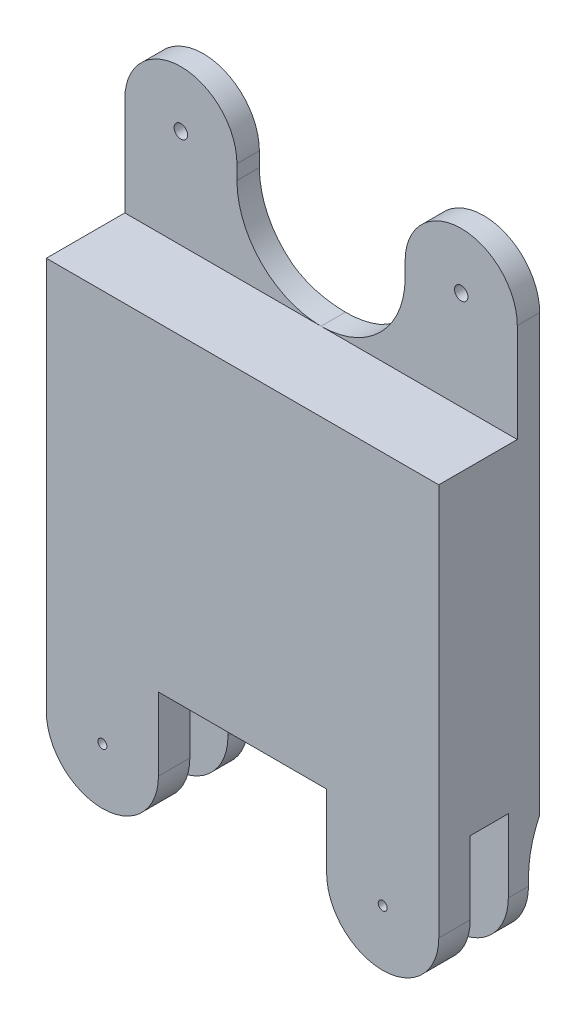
ISO-10303-21;
HEADER;
FILE_DESCRIPTION(('STEP AP214'),'2;1');
FILE_NAME('part.step','',(''),(''),'','','');
FILE_SCHEMA(('AUTOMOTIVE_DESIGN { 1 0 10303 214 1 1 1 1 }'));
ENDSEC;
DATA;
#1=APPLICATION_CONTEXT('core data for automotive mechanical design processes');
#2=APPLICATION_PROTOCOL_DEFINITION('international standard','automotive_design',2000,#1);
#3=PRODUCT_CONTEXT('',#1,'mechanical');
#4=PRODUCT('Part','Part','',(#3));
#5=PRODUCT_RELATED_PRODUCT_CATEGORY('part','',(#4));
#6=PRODUCT_DEFINITION_FORMATION('','',#4);
#7=PRODUCT_DEFINITION_CONTEXT('part definition',#1,'design');
#8=PRODUCT_DEFINITION('design','',#6,#7);
#9=PRODUCT_DEFINITION_SHAPE('','',#8);
#10=(LENGTH_UNIT() NAMED_UNIT(*) SI_UNIT(.MILLI.,.METRE.));
#11=(NAMED_UNIT(*) PLANE_ANGLE_UNIT() SI_UNIT($,.RADIAN.));
#12=(NAMED_UNIT(*) SI_UNIT($,.STERADIAN.) SOLID_ANGLE_UNIT());
#13=UNCERTAINTY_MEASURE_WITH_UNIT(LENGTH_MEASURE(1.E-05),#10,'distance_accuracy_value','');
#14=(GEOMETRIC_REPRESENTATION_CONTEXT(3) GLOBAL_UNCERTAINTY_ASSIGNED_CONTEXT((#13)) GLOBAL_UNIT_ASSIGNED_CONTEXT((#10,
#11,#12)) REPRESENTATION_CONTEXT('',''));
#15=CARTESIAN_POINT('',(0.,0.,0.));
#16=DIRECTION('',(0.,0.,1.));
#17=DIRECTION('',(1.,0.,0.));
#18=AXIS2_PLACEMENT_3D('',#15,#16,#17);
#19=CARTESIAN_POINT('',(17.5,80.0999999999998,-5.99999831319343));
#20=DIRECTION('',(0.,0.,1.));
#21=DIRECTION('',(1.,0.,0.));
#22=AXIS2_PLACEMENT_3D('',#19,#20,#21);
#23=PLANE('',#22);
#24=CARTESIAN_POINT('',(-12.5,88.8999999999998,-5.99999831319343));
#25=DIRECTION('',(0.,0.,-1.));
#26=DIRECTION('',(-1.,0.,0.));
#27=AXIS2_PLACEMENT_3D('',#24,#25,#26);
#28=CIRCLE('',#27,0.600000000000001);
#29=CARTESIAN_POINT('',(-13.1,88.8999999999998,-5.99999831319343));
#30=VERTEX_POINT('',#29);
#31=EDGE_CURVE('E672',#30,#30,#28,.T.);
#32=ORIENTED_EDGE('',*,*,#31,.F.);
#33=EDGE_LOOP('',(#32));
#34=FACE_BOUND('',#33,.T.);
#35=CARTESIAN_POINT('',(0.,87.5999999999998,-5.99999831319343));
#36=DIRECTION('',(0.,0.,1.));
#37=DIRECTION('',(1.,0.,0.));
#38=AXIS2_PLACEMENT_3D('',#35,#36,#37);
#39=CIRCLE('',#38,7.5);
#40=CARTESIAN_POINT('',(-7.49999999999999,87.5999999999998,-5.99999831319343));
#41=VERTEX_POINT('',#40);
#42=CARTESIAN_POINT('',(-4.62908514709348,81.6990195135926,-5.99999831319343));
#43=VERTEX_POINT('',#42);
#44=EDGE_CURVE('E516',#41,#43,#39,.T.);
#45=ORIENTED_EDGE('',*,*,#44,.T.);
#46=DIRECTION('',(1.,0.,0.));
#47=VECTOR('',#46,1.);
#48=CARTESIAN_POINT('',(17.5,81.6990195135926,-5.99999831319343));
#49=LINE('',#48,#47);
#50=CARTESIAN_POINT('',(-11.3490195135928,81.6990195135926,-5.99999831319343));
#51=VERTEX_POINT('',#50);
#52=EDGE_CURVE('E534',#43,#51,#49,.F.);
#53=ORIENTED_EDGE('',*,*,#52,.T.);
#54=DIRECTION('',(0.,1.,0.));
#55=VECTOR('',#54,1.);
#56=CARTESIAN_POINT('',(-11.3490195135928,80.0999999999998,-5.99999831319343));
#57=LINE('',#56,#55);
#58=CARTESIAN_POINT('',(-11.3490195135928,50.0999999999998,-5.99999831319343));
#59=VERTEX_POINT('',#58);
#60=EDGE_CURVE('E533',#51,#59,#57,.F.);
#61=ORIENTED_EDGE('',*,*,#60,.T.);
#62=DIRECTION('',(-1.,0.,0.));
#63=VECTOR('',#62,1.);
#64=CARTESIAN_POINT('',(17.5,50.0999999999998,-5.99999831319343));
#65=LINE('',#64,#63);
#66=CARTESIAN_POINT('',(-17.5,50.0999999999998,-5.99999831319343));
#67=VERTEX_POINT('',#66);
#68=EDGE_CURVE('E456',#59,#67,#65,.T.);
#69=ORIENTED_EDGE('',*,*,#68,.T.);
#70=DIRECTION('',(0.,-1.,0.));
#71=VECTOR('',#70,1.);
#72=CARTESIAN_POINT('',(-17.5,80.0999999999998,-5.99999831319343));
#73=LINE('',#72,#71);
#74=CARTESIAN_POINT('',(-17.5,88.8999999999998,-5.99999831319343));
#75=VERTEX_POINT('',#74);
#76=EDGE_CURVE('E469',#75,#67,#73,.T.);
#77=ORIENTED_EDGE('',*,*,#76,.F.);
#78=CARTESIAN_POINT('',(-12.5,88.8999999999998,-5.99999831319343));
#79=DIRECTION('',(0.,0.,-1.));
#80=DIRECTION('',(-1.,0.,0.));
#81=AXIS2_PLACEMENT_3D('',#78,#79,#80);
#82=CIRCLE('',#81,5.);
#83=CARTESIAN_POINT('',(-7.49999999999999,88.8999999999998,-5.99999831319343));
#84=VERTEX_POINT('',#83);
#85=EDGE_CURVE('E554',#75,#84,#82,.T.);
#86=ORIENTED_EDGE('',*,*,#85,.T.);
#87=DIRECTION('',(0.,-1.,0.));
#88=VECTOR('',#87,1.);
#89=CARTESIAN_POINT('',(-7.49999999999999,80.0999999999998,-5.99999831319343));
#90=LINE('',#89,#88);
#91=EDGE_CURVE('E552',#84,#41,#90,.T.);
#92=ORIENTED_EDGE('',*,*,#91,.T.);
#93=EDGE_LOOP('',(#45,#53,#61,#69,#77,#86,#92));
#94=FACE_BOUND('',#93,.T.);
#95=ADVANCED_FACE('F33',(#34,#94),#23,.F.);
#96=CARTESIAN_POINT('',(12.5,88.8999999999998,-5.99999831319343));
#97=DIRECTION('',(0.,0.,-1.));
#98=DIRECTION('',(-1.,0.,0.));
#99=AXIS2_PLACEMENT_3D('',#96,#97,#98);
#100=CIRCLE('',#99,0.600000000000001);
#101=CARTESIAN_POINT('',(11.9,88.8999999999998,-5.99999831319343));
#102=VERTEX_POINT('',#101);
#103=EDGE_CURVE('E529',#102,#102,#100,.T.);
#104=ORIENTED_EDGE('',*,*,#103,.F.);
#105=EDGE_LOOP('',(#104));
#106=FACE_BOUND('',#105,.T.);
#107=DIRECTION('',(0.,-1.,0.));
#108=VECTOR('',#107,1.);
#109=CARTESIAN_POINT('',(11.3490195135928,80.0999999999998,-5.99999831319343));
#110=LINE('',#109,#108);
#111=CARTESIAN_POINT('',(11.3490195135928,50.0999999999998,-5.99999831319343));
#112=VERTEX_POINT('',#111);
#113=CARTESIAN_POINT('',(11.3490195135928,81.6990195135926,-5.99999831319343));
#114=VERTEX_POINT('',#113);
#115=EDGE_CURVE('E526',#112,#114,#110,.F.);
#116=ORIENTED_EDGE('',*,*,#115,.T.);
#117=DIRECTION('',(1.,0.,0.));
#118=VECTOR('',#117,1.);
#119=CARTESIAN_POINT('',(17.5,81.6990195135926,-5.99999831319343));
#120=LINE('',#119,#118);
#121=CARTESIAN_POINT('',(4.62908514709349,81.6990195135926,-5.99999831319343));
#122=VERTEX_POINT('',#121);
#123=EDGE_CURVE('E531',#114,#122,#120,.F.);
#124=ORIENTED_EDGE('',*,*,#123,.T.);
#125=CARTESIAN_POINT('',(0.,87.5999999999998,-5.99999831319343));
#126=DIRECTION('',(0.,0.,1.));
#127=DIRECTION('',(1.,0.,0.));
#128=AXIS2_PLACEMENT_3D('',#125,#126,#127);
#129=CIRCLE('',#128,7.5);
#130=CARTESIAN_POINT('',(7.49999999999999,87.5999999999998,-5.99999831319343));
#131=VERTEX_POINT('',#130);
#132=EDGE_CURVE('E521',#122,#131,#129,.T.);
#133=ORIENTED_EDGE('',*,*,#132,.T.);
#134=DIRECTION('',(0.,1.,0.));
#135=VECTOR('',#134,1.);
#136=CARTESIAN_POINT('',(7.49999999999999,80.0999999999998,-5.99999831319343));
#137=LINE('',#136,#135);
#138=CARTESIAN_POINT('',(7.5,88.8999999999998,-5.99999831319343));
#139=VERTEX_POINT('',#138);
#140=EDGE_CURVE('E658',#131,#139,#137,.T.);
#141=ORIENTED_EDGE('',*,*,#140,.T.);
#142=CARTESIAN_POINT('',(12.5,88.8999999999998,-5.99999831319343));
#143=DIRECTION('',(0.,0.,-1.));
#144=DIRECTION('',(1.,0.,0.));
#145=AXIS2_PLACEMENT_3D('',#142,#143,#144);
#146=CIRCLE('',#145,5.);
#147=CARTESIAN_POINT('',(17.5,88.8999999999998,-5.99999831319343));
#148=VERTEX_POINT('',#147);
#149=EDGE_CURVE('E656',#139,#148,#146,.T.);
#150=ORIENTED_EDGE('',*,*,#149,.T.);
#151=DIRECTION('',(0.,-1.,0.));
#152=VECTOR('',#151,1.);
#153=CARTESIAN_POINT('',(17.5,80.0999999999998,-5.99999831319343));
#154=LINE('',#153,#152);
#155=CARTESIAN_POINT('',(17.4999963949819,50.0999999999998,-5.99999831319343));
#156=VERTEX_POINT('',#155);
#157=EDGE_CURVE('E472',#148,#156,#154,.T.);
#158=ORIENTED_EDGE('',*,*,#157,.T.);
#159=EDGE_CURVE('E460',#156,#112,#65,.T.);
#160=ORIENTED_EDGE('',*,*,#159,.T.);
#161=EDGE_LOOP('',(#116,#124,#133,#141,#150,#158,#160));
#162=FACE_BOUND('',#161,.T.);
#163=ADVANCED_FACE('F345',(#106,#162),#23,.F.);
#164=CARTESIAN_POINT('',(7.49999999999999,50.0999999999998,-5.99999831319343));
#165=DIRECTION('',(0.999999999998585,1.68234134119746E-06,0.));
#166=DIRECTION('',(-1.68234134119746E-06,0.999999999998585,0.));
#167=AXIS2_PLACEMENT_3D('',#164,#165,#166);
#168=PLANE('',#167);
#169=DIRECTION('',(1.68234134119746E-06,-0.999999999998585,0.));
#170=VECTOR('',#169,1.);
#171=CARTESIAN_POINT('',(7.49999999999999,50.0999999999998,-3.19999831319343));
#172=LINE('',#171,#170);
#173=CARTESIAN_POINT('',(7.49999999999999,50.0999999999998,-3.19999831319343));
#174=VERTEX_POINT('',#173);
#175=CARTESIAN_POINT('',(7.50000841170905,45.099998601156,-3.19999831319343));
#176=VERTEX_POINT('',#175);
#177=EDGE_CURVE('E618',#174,#176,#172,.T.);
#178=ORIENTED_EDGE('',*,*,#177,.F.);
#179=DIRECTION('',(0.,-1.,0.));
#180=VECTOR('',#179,1.);
#181=CARTESIAN_POINT('',(7.49999999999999,51.5999999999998,-3.19999831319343));
#182=LINE('',#181,#180);
#183=CARTESIAN_POINT('',(7.49999999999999,51.5999999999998,-3.19999831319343));
#184=VERTEX_POINT('',#183);
#185=EDGE_CURVE('E602',#184,#174,#182,.T.);
#186=ORIENTED_EDGE('',*,*,#185,.F.);
#187=DIRECTION('',(0.,0.,1.));
#188=VECTOR('',#187,1.);
#189=CARTESIAN_POINT('',(7.49999999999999,51.5999999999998,-5.99999831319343));
#190=LINE('',#189,#188);
#191=CARTESIAN_POINT('',(7.49999747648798,51.5999999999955,-6.8960916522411));
#192=VERTEX_POINT('',#191);
#193=EDGE_CURVE('E584',#192,#184,#190,.T.);
#194=ORIENTED_EDGE('',*,*,#193,.F.);
#195=CARTESIAN_POINT('',(7.50000733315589,45.7411010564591,-14.9999983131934));
#196=DIRECTION('',(0.999999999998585,1.68234134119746E-06,0.));
#197=DIRECTION('',(1.68234134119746E-06,-0.999999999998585,0.));
#198=AXIS2_PLACEMENT_3D('',#195,#196,#197);
#199=ELLIPSE('',#198,10.0000000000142,10.);
#200=CARTESIAN_POINT('',(7.50000733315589,45.7411010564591,-4.99999831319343));
#201=VERTEX_POINT('',#200);
#202=EDGE_CURVE('E500',#192,#201,#199,.T.);
#203=ORIENTED_EDGE('',*,*,#202,.T.);
#204=DIRECTION('',(-1.68234134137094E-06,0.999999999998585,0.));
#205=VECTOR('',#204,1.);
#206=CARTESIAN_POINT('',(7.49999999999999,50.0999999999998,-4.99999831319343));
#207=LINE('',#206,#205);
#208=CARTESIAN_POINT('',(7.50000841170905,45.099998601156,-4.99999831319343));
#209=VERTEX_POINT('',#208);
#210=EDGE_CURVE('E418',#209,#201,#207,.T.);
#211=ORIENTED_EDGE('',*,*,#210,.F.);
#212=DIRECTION('',(0.,0.,1.));
#213=VECTOR('',#212,1.);
#214=CARTESIAN_POINT('',(7.50000841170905,45.099998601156,-5.99999831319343));
#215=LINE('',#214,#213);
#216=EDGE_CURVE('E439',#209,#176,#215,.T.);
#217=ORIENTED_EDGE('',*,*,#216,.T.);
#218=EDGE_LOOP('',(#178,#186,#194,#203,#211,#217));
#219=FACE_BOUND('',#218,.T.);
#220=ADVANCED_FACE('F351',(#219),#168,.F.);
#221=CARTESIAN_POINT('',(12.5,45.0999999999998,-5.99999831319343));
#222=DIRECTION('',(0.,0.,1.));
#223=DIRECTION('',(-1.,0.,0.));
#224=AXIS2_PLACEMENT_3D('',#221,#222,#223);
#225=CYLINDRICAL_SURFACE('',#224,4.99999579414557);
#226=CARTESIAN_POINT('',(12.5,45.0999999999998,-3.19999831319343));
#227=DIRECTION('',(0.,0.,1.));
#228=DIRECTION('',(1.,0.,0.));
#229=AXIS2_PLACEMENT_3D('',#226,#227,#228);
#230=CIRCLE('',#229,4.99999369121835);
#231=CARTESIAN_POINT('',(17.4999957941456,45.0999999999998,-3.19999831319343));
#232=VERTEX_POINT('',#231);
#233=EDGE_CURVE('E612',#176,#232,#230,.T.);
#234=ORIENTED_EDGE('',*,*,#233,.F.);
#235=ORIENTED_EDGE('',*,*,#216,.F.);
#236=CARTESIAN_POINT('',(12.5,45.0999999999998,-4.99999831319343));
#237=DIRECTION('',(0.,0.,-1.));
#238=DIRECTION('',(-1.,0.,0.));
#239=AXIS2_PLACEMENT_3D('',#236,#237,#238);
#240=CIRCLE('',#239,4.99999369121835);
#241=CARTESIAN_POINT('',(17.4999957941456,45.0999999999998,-4.99999831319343));
#242=VERTEX_POINT('',#241);
#243=EDGE_CURVE('E415',#242,#209,#240,.T.);
#244=ORIENTED_EDGE('',*,*,#243,.F.);
#245=DIRECTION('',(0.,0.,1.));
#246=VECTOR('',#245,1.);
#247=CARTESIAN_POINT('',(17.4999957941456,45.0999999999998,-5.99999831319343));
#248=LINE('',#247,#246);
#249=EDGE_CURVE('E436',#242,#232,#248,.T.);
#250=ORIENTED_EDGE('',*,*,#249,.T.);
#251=EDGE_LOOP('',(#234,#235,#244,#250));
#252=FACE_BOUND('',#251,.T.);
#253=ADVANCED_FACE('F645',(#252),#225,.T.);
#254=CARTESIAN_POINT('',(12.5,45.0999999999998,-5.99999831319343));
#255=DIRECTION('',(0.,0.,1.));
#256=DIRECTION('',(-1.,0.,0.));
#257=AXIS2_PLACEMENT_3D('',#254,#255,#256);
#258=CYLINDRICAL_SURFACE('',#257,0.399999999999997);
#259=CARTESIAN_POINT('',(12.5,45.0999999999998,-4.99999831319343));
#260=DIRECTION('',(0.,0.,-1.));
#261=DIRECTION('',(-1.,0.,0.));
#262=AXIS2_PLACEMENT_3D('',#259,#260,#261);
#263=CIRCLE('',#262,0.399999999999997);
#264=CARTESIAN_POINT('',(12.1,45.0999999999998,-4.99999831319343));
#265=VERTEX_POINT('',#264);
#266=EDGE_CURVE('E433',#265,#265,#263,.T.);
#267=ORIENTED_EDGE('',*,*,#266,.T.);
#268=EDGE_LOOP('',(#267));
#269=FACE_BOUND('',#268,.T.);
#270=CARTESIAN_POINT('',(12.5,45.0999999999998,-3.19999831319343));
#271=DIRECTION('',(0.,0.,1.));
#272=DIRECTION('',(1.,0.,0.));
#273=AXIS2_PLACEMENT_3D('',#270,#271,#272);
#274=CIRCLE('',#273,0.399999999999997);
#275=CARTESIAN_POINT('',(12.9,45.0999999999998,-3.19999831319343));
#276=VERTEX_POINT('',#275);
#277=EDGE_CURVE('E404',#276,#276,#274,.T.);
#278=ORIENTED_EDGE('',*,*,#277,.T.);
#279=EDGE_LOOP('',(#278));
#280=FACE_BOUND('',#279,.T.);
#281=ADVANCED_FACE('F630',(#269,#280),#258,.F.);
#282=CARTESIAN_POINT('',(-12.5,45.0999999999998,-5.99999831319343));
#283=DIRECTION('',(0.,0.,1.));
#284=DIRECTION('',(-1.,0.,0.));
#285=AXIS2_PLACEMENT_3D('',#282,#283,#284);
#286=CYLINDRICAL_SURFACE('',#285,5.);
#287=CARTESIAN_POINT('',(-12.5,45.0999999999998,-3.19999831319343));
#288=DIRECTION('',(0.,0.,1.));
#289=DIRECTION('',(1.,0.,0.));
#290=AXIS2_PLACEMENT_3D('',#287,#288,#289);
#291=CIRCLE('',#290,5.);
#292=CARTESIAN_POINT('',(-17.5,45.0999999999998,-3.19999831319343));
#293=VERTEX_POINT('',#292);
#294=CARTESIAN_POINT('',(-7.49999999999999,45.0999999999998,-3.19999831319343));
#295=VERTEX_POINT('',#294);
#296=EDGE_CURVE('E605',#293,#295,#291,.T.);
#297=ORIENTED_EDGE('',*,*,#296,.F.);
#298=DIRECTION('',(0.,0.,1.));
#299=VECTOR('',#298,1.);
#300=CARTESIAN_POINT('',(-17.5,45.0999999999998,-5.99999831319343));
#301=LINE('',#300,#299);
#302=CARTESIAN_POINT('',(-17.5,45.0999999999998,-4.99999831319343));
#303=VERTEX_POINT('',#302);
#304=EDGE_CURVE('E429',#303,#293,#301,.T.);
#305=ORIENTED_EDGE('',*,*,#304,.F.);
#306=CARTESIAN_POINT('',(-12.5,45.0999999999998,-4.99999831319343));
#307=DIRECTION('',(0.,0.,-1.));
#308=DIRECTION('',(-1.,0.,0.));
#309=AXIS2_PLACEMENT_3D('',#306,#307,#308);
#310=CIRCLE('',#309,5.);
#311=CARTESIAN_POINT('',(-7.49999999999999,45.0999999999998,-4.99999831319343));
#312=VERTEX_POINT('',#311);
#313=EDGE_CURVE('E424',#312,#303,#310,.T.);
#314=ORIENTED_EDGE('',*,*,#313,.F.);
#315=DIRECTION('',(0.,0.,1.));
#316=VECTOR('',#315,1.);
#317=CARTESIAN_POINT('',(-7.49999999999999,45.0999999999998,-5.99999831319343));
#318=LINE('',#317,#316);
#319=EDGE_CURVE('E432',#312,#295,#318,.T.);
#320=ORIENTED_EDGE('',*,*,#319,.T.);
#321=EDGE_LOOP('',(#297,#305,#314,#320));
#322=FACE_BOUND('',#321,.T.);
#323=ADVANCED_FACE('F764',(#322),#286,.T.);
#324=CARTESIAN_POINT('',(-7.49999999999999,50.0999999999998,-5.99999831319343));
#325=DIRECTION('',(-1.,0.,0.));
#326=DIRECTION('',(0.,-1.,0.));
#327=AXIS2_PLACEMENT_3D('',#324,#325,#326);
#328=PLANE('',#327);
#329=DIRECTION('',(0.,1.,0.));
#330=VECTOR('',#329,1.);
#331=CARTESIAN_POINT('',(-7.49999999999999,45.0999999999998,-3.19999831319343));
#332=LINE('',#331,#330);
#333=CARTESIAN_POINT('',(-7.49999999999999,51.5999999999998,-3.19999831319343));
#334=VERTEX_POINT('',#333);
#335=EDGE_CURVE('E622',#295,#334,#332,.T.);
#336=ORIENTED_EDGE('',*,*,#335,.F.);
#337=ORIENTED_EDGE('',*,*,#319,.F.);
#338=DIRECTION('',(0.,-1.,0.));
#339=VECTOR('',#338,1.);
#340=CARTESIAN_POINT('',(-7.49999999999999,45.0999999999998,-4.99999831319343));
#341=LINE('',#340,#339);
#342=CARTESIAN_POINT('',(-7.49999999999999,45.7411010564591,-4.99999831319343));
#343=VERTEX_POINT('',#342);
#344=EDGE_CURVE('E422',#343,#312,#341,.T.);
#345=ORIENTED_EDGE('',*,*,#344,.F.);
#346=CARTESIAN_POINT('',(-7.49999999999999,45.7411010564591,-14.9999983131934));
#347=DIRECTION('',(-1.,0.,0.));
#348=DIRECTION('',(0.,-1.,0.));
#349=AXIS2_PLACEMENT_3D('',#346,#347,#348);
#350=CIRCLE('',#349,10.);
#351=CARTESIAN_POINT('',(-7.49999999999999,51.5999999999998,-6.89609165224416));
#352=VERTEX_POINT('',#351);
#353=EDGE_CURVE('E502',#343,#352,#350,.T.);
#354=ORIENTED_EDGE('',*,*,#353,.T.);
#355=DIRECTION('',(0.,0.,-1.));
#356=VECTOR('',#355,1.);
#357=CARTESIAN_POINT('',(-7.49999999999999,51.5999999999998,-3.19999831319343));
#358=LINE('',#357,#356);
#359=EDGE_CURVE('E582',#334,#352,#358,.T.);
#360=ORIENTED_EDGE('',*,*,#359,.F.);
#361=EDGE_LOOP('',(#336,#337,#345,#354,#360));
#362=FACE_BOUND('',#361,.T.);
#363=ADVANCED_FACE('F760',(#362),#328,.F.);
#364=CARTESIAN_POINT('',(-12.5,45.0999999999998,-5.99999831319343));
#365=DIRECTION('',(0.,0.,1.));
#366=DIRECTION('',(-1.,0.,0.));
#367=AXIS2_PLACEMENT_3D('',#364,#365,#366);
#368=CYLINDRICAL_SURFACE('',#367,0.399999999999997);
#369=CARTESIAN_POINT('',(-12.5,45.0999999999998,-4.99999831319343));
#370=DIRECTION('',(0.,0.,-1.));
#371=DIRECTION('',(-1.,0.,0.));
#372=AXIS2_PLACEMENT_3D('',#369,#370,#371);
#373=CIRCLE('',#372,0.399999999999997);
#374=CARTESIAN_POINT('',(-12.9,45.0999999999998,-4.99999831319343));
#375=VERTEX_POINT('',#374);
#376=EDGE_CURVE('E421',#375,#375,#373,.T.);
#377=ORIENTED_EDGE('',*,*,#376,.T.);
#378=EDGE_LOOP('',(#377));
#379=FACE_BOUND('',#378,.T.);
#380=CARTESIAN_POINT('',(-12.5,45.0999999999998,-3.19999831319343));
#381=DIRECTION('',(0.,0.,1.));
#382=DIRECTION('',(1.,0.,0.));
#383=AXIS2_PLACEMENT_3D('',#380,#381,#382);
#384=CIRCLE('',#383,0.399999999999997);
#385=CARTESIAN_POINT('',(-12.1,45.0999999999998,-3.19999831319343));
#386=VERTEX_POINT('',#385);
#387=EDGE_CURVE('E620',#386,#386,#384,.T.);
#388=ORIENTED_EDGE('',*,*,#387,.T.);
#389=EDGE_LOOP('',(#388));
#390=FACE_BOUND('',#389,.T.);
#391=ADVANCED_FACE('F376',(#379,#390),#368,.F.);
#392=CARTESIAN_POINT('',(7.49999999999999,50.0999999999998,3.));
#393=DIRECTION('',(0.999999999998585,1.68234134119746E-06,0.));
#394=DIRECTION('',(-1.68234134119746E-06,0.999999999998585,0.));
#395=AXIS2_PLACEMENT_3D('',#392,#393,#394);
#396=PLANE('',#395);
#397=DIRECTION('',(-1.26175601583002E-06,0.999999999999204,0.));
#398=VECTOR('',#397,1.);
#399=CARTESIAN_POINT('',(7.50000630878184,45.0999986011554,0.2));
#400=LINE('',#399,#398);
#401=CARTESIAN_POINT('',(7.50000525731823,45.0999986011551,0.2));
#402=VERTEX_POINT('',#401);
#403=CARTESIAN_POINT('',(7.49999999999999,50.0999999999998,0.2));
#404=VERTEX_POINT('',#403);
#405=EDGE_CURVE('E399',#402,#404,#400,.T.);
#406=ORIENTED_EDGE('',*,*,#405,.F.);
#407=DIRECTION('',(0.,0.,-1.));
#408=VECTOR('',#407,1.);
#409=CARTESIAN_POINT('',(7.50000841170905,45.099998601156,3.));
#410=LINE('',#409,#408);
#411=CARTESIAN_POINT('',(7.50000841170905,45.099998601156,3.));
#412=VERTEX_POINT('',#411);
#413=EDGE_CURVE('E485',#412,#402,#410,.T.);
#414=ORIENTED_EDGE('',*,*,#413,.F.);
#415=DIRECTION('',(1.68234134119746E-06,-0.999999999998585,0.));
#416=VECTOR('',#415,1.);
#417=CARTESIAN_POINT('',(7.49999999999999,50.0999999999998,3.));
#418=LINE('',#417,#416);
#419=CARTESIAN_POINT('',(7.49999999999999,50.0999999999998,3.));
#420=VERTEX_POINT('',#419);
#421=EDGE_CURVE('E480',#420,#412,#418,.T.);
#422=ORIENTED_EDGE('',*,*,#421,.F.);
#423=DIRECTION('',(0.,-1.,0.));
#424=VECTOR('',#423,1.);
#425=CARTESIAN_POINT('',(7.49999999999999,51.5999999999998,3.));
#426=LINE('',#425,#424);
#427=CARTESIAN_POINT('',(7.49999999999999,51.5999999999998,3.));
#428=VERTEX_POINT('',#427);
#429=EDGE_CURVE('E603',#428,#420,#426,.T.);
#430=ORIENTED_EDGE('',*,*,#429,.F.);
#431=DIRECTION('',(0.,0.,1.));
#432=VECTOR('',#431,1.);
#433=CARTESIAN_POINT('',(7.49999999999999,51.5999999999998,0.2));
#434=LINE('',#433,#432);
#435=CARTESIAN_POINT('',(7.49999999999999,51.5999999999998,0.2));
#436=VERTEX_POINT('',#435);
#437=EDGE_CURVE('E596',#436,#428,#434,.T.);
#438=ORIENTED_EDGE('',*,*,#437,.F.);
#439=DIRECTION('',(0.,-1.,0.));
#440=VECTOR('',#439,1.);
#441=CARTESIAN_POINT('',(7.49999999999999,51.5999999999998,0.2));
#442=LINE('',#441,#440);
#443=EDGE_CURVE('E606',#436,#404,#442,.T.);
#444=ORIENTED_EDGE('',*,*,#443,.T.);
#445=EDGE_LOOP('',(#406,#414,#422,#430,#438,#444));
#446=FACE_BOUND('',#445,.T.);
#447=ADVANCED_FACE('F373',(#446),#396,.F.);
#448=CARTESIAN_POINT('',(12.5,45.0999999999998,3.));
#449=DIRECTION('',(0.,0.,-1.));
#450=DIRECTION('',(-1.,0.,0.));
#451=AXIS2_PLACEMENT_3D('',#448,#449,#450);
#452=CYLINDRICAL_SURFACE('',#451,4.99999579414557);
#453=CARTESIAN_POINT('',(12.5,45.0999999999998,0.2));
#454=DIRECTION('',(0.,0.,-1.));
#455=DIRECTION('',(-1.,0.,0.));
#456=AXIS2_PLACEMENT_3D('',#453,#454,#455);
#457=CIRCLE('',#456,4.99999474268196);
#458=CARTESIAN_POINT('',(17.4999957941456,45.0999999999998,0.2));
#459=VERTEX_POINT('',#458);
#460=EDGE_CURVE('E396',#459,#402,#457,.T.);
#461=ORIENTED_EDGE('',*,*,#460,.F.);
#462=DIRECTION('',(0.,0.,-1.));
#463=VECTOR('',#462,1.);
#464=CARTESIAN_POINT('',(17.4999957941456,45.0999999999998,3.));
#465=LINE('',#464,#463);
#466=CARTESIAN_POINT('',(17.4999957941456,45.0999999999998,3.));
#467=VERTEX_POINT('',#466);
#468=EDGE_CURVE('E393',#467,#459,#465,.T.);
#469=ORIENTED_EDGE('',*,*,#468,.F.);
#470=CARTESIAN_POINT('',(12.5,45.0999999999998,3.));
#471=DIRECTION('',(0.,0.,1.));
#472=DIRECTION('',(-1.,0.,0.));
#473=AXIS2_PLACEMENT_3D('',#470,#471,#472);
#474=CIRCLE('',#473,4.99999579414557);
#475=EDGE_CURVE('E482',#412,#467,#474,.T.);
#476=ORIENTED_EDGE('',*,*,#475,.F.);
#477=ORIENTED_EDGE('',*,*,#413,.T.);
#478=EDGE_LOOP('',(#461,#469,#476,#477));
#479=FACE_BOUND('',#478,.T.);
#480=ADVANCED_FACE('F363',(#479),#452,.T.);
#481=CARTESIAN_POINT('',(12.5,45.0999999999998,3.));
#482=DIRECTION('',(0.,0.,-1.));
#483=DIRECTION('',(-1.,0.,0.));
#484=AXIS2_PLACEMENT_3D('',#481,#482,#483);
#485=CYLINDRICAL_SURFACE('',#484,0.399999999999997);
#486=CARTESIAN_POINT('',(12.5,45.0999999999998,3.));
#487=DIRECTION('',(0.,0.,1.));
#488=DIRECTION('',(-1.,0.,0.));
#489=AXIS2_PLACEMENT_3D('',#486,#487,#488);
#490=CIRCLE('',#489,0.399999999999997);
#491=CARTESIAN_POINT('',(12.1,45.0999999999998,3.));
#492=VERTEX_POINT('',#491);
#493=EDGE_CURVE('E475',#492,#492,#490,.T.);
#494=ORIENTED_EDGE('',*,*,#493,.T.);
#495=EDGE_LOOP('',(#494));
#496=FACE_BOUND('',#495,.T.);
#497=CARTESIAN_POINT('',(12.5,45.0999999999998,0.2));
#498=DIRECTION('',(0.,0.,-1.));
#499=DIRECTION('',(-1.,0.,0.));
#500=AXIS2_PLACEMENT_3D('',#497,#498,#499);
#501=CIRCLE('',#500,0.399999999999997);
#502=CARTESIAN_POINT('',(12.1,45.0999999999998,0.2));
#503=VERTEX_POINT('',#502);
#504=EDGE_CURVE('E425',#503,#503,#501,.T.);
#505=ORIENTED_EDGE('',*,*,#504,.T.);
#506=EDGE_LOOP('',(#505));
#507=FACE_BOUND('',#506,.T.);
#508=ADVANCED_FACE('F359',(#496,#507),#485,.F.);
#509=CARTESIAN_POINT('',(-12.5,45.0999999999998,3.));
#510=DIRECTION('',(0.,0.,-1.));
#511=DIRECTION('',(-1.,0.,0.));
#512=AXIS2_PLACEMENT_3D('',#509,#510,#511);
#513=CYLINDRICAL_SURFACE('',#512,5.);
#514=CARTESIAN_POINT('',(-12.5,45.0999999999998,0.2));
#515=DIRECTION('',(0.,0.,-1.));
#516=DIRECTION('',(-1.,0.,0.));
#517=AXIS2_PLACEMENT_3D('',#514,#515,#516);
#518=CIRCLE('',#517,5.);
#519=CARTESIAN_POINT('',(-7.49999999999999,45.0999999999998,0.2));
#520=VERTEX_POINT('',#519);
#521=CARTESIAN_POINT('',(-17.5,45.0999999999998,0.2));
#522=VERTEX_POINT('',#521);
#523=EDGE_CURVE('E410',#520,#522,#518,.T.);
#524=ORIENTED_EDGE('',*,*,#523,.F.);
#525=DIRECTION('',(0.,0.,-1.));
#526=VECTOR('',#525,1.);
#527=CARTESIAN_POINT('',(-7.49999999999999,45.0999999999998,3.));
#528=LINE('',#527,#526);
#529=CARTESIAN_POINT('',(-7.49999999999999,45.0999999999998,3.));
#530=VERTEX_POINT('',#529);
#531=EDGE_CURVE('E453',#530,#520,#528,.T.);
#532=ORIENTED_EDGE('',*,*,#531,.F.);
#533=CARTESIAN_POINT('',(-12.5,45.0999999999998,3.));
#534=DIRECTION('',(0.,0.,1.));
#535=DIRECTION('',(1.,0.,0.));
#536=AXIS2_PLACEMENT_3D('',#533,#534,#535);
#537=CIRCLE('',#536,5.);
#538=CARTESIAN_POINT('',(-17.5,45.0999999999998,3.));
#539=VERTEX_POINT('',#538);
#540=EDGE_CURVE('E445',#539,#530,#537,.T.);
#541=ORIENTED_EDGE('',*,*,#540,.F.);
#542=DIRECTION('',(0.,0.,-1.));
#543=VECTOR('',#542,1.);
#544=CARTESIAN_POINT('',(-17.5,45.0999999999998,3.));
#545=LINE('',#544,#543);
#546=EDGE_CURVE('E450',#539,#522,#545,.T.);
#547=ORIENTED_EDGE('',*,*,#546,.T.);
#548=EDGE_LOOP('',(#524,#532,#541,#547));
#549=FACE_BOUND('',#548,.T.);
#550=ADVANCED_FACE('F362',(#549),#513,.T.);
#551=CARTESIAN_POINT('',(-7.49999999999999,50.0999999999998,3.));
#552=DIRECTION('',(-1.,0.,0.));
#553=DIRECTION('',(0.,-1.,0.));
#554=AXIS2_PLACEMENT_3D('',#551,#552,#553);
#555=PLANE('',#554);
#556=DIRECTION('',(0.,-1.,0.));
#557=VECTOR('',#556,1.);
#558=CARTESIAN_POINT('',(-7.49999999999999,50.0999999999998,0.2));
#559=LINE('',#558,#557);
#560=CARTESIAN_POINT('',(-7.49999999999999,51.5999999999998,0.2));
#561=VERTEX_POINT('',#560);
#562=EDGE_CURVE('E397',#561,#520,#559,.T.);
#563=ORIENTED_EDGE('',*,*,#562,.F.);
#564=DIRECTION('',(0.,0.,-1.));
#565=VECTOR('',#564,1.);
#566=CARTESIAN_POINT('',(-7.49999999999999,51.5999999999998,3.));
#567=LINE('',#566,#565);
#568=CARTESIAN_POINT('',(-7.49999999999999,51.5999999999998,3.));
#569=VERTEX_POINT('',#568);
#570=EDGE_CURVE('E567',#569,#561,#567,.T.);
#571=ORIENTED_EDGE('',*,*,#570,.F.);
#572=DIRECTION('',(0.,1.,0.));
#573=VECTOR('',#572,1.);
#574=CARTESIAN_POINT('',(-7.49999999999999,50.0999999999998,3.));
#575=LINE('',#574,#573);
#576=EDGE_CURVE('E448',#530,#569,#575,.T.);
#577=ORIENTED_EDGE('',*,*,#576,.F.);
#578=ORIENTED_EDGE('',*,*,#531,.T.);
#579=EDGE_LOOP('',(#563,#571,#577,#578));
#580=FACE_BOUND('',#579,.T.);
#581=ADVANCED_FACE('F778',(#580),#555,.F.);
#582=CARTESIAN_POINT('',(-12.5,45.0999999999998,3.));
#583=DIRECTION('',(0.,0.,-1.));
#584=DIRECTION('',(-1.,0.,0.));
#585=AXIS2_PLACEMENT_3D('',#582,#583,#584);
#586=CYLINDRICAL_SURFACE('',#585,0.399999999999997);
#587=CARTESIAN_POINT('',(-12.5,45.0999999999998,3.));
#588=DIRECTION('',(0.,0.,1.));
#589=DIRECTION('',(1.,0.,0.));
#590=AXIS2_PLACEMENT_3D('',#587,#588,#589);
#591=CIRCLE('',#590,0.399999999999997);
#592=CARTESIAN_POINT('',(-12.1,45.0999999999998,3.));
#593=VERTEX_POINT('',#592);
#594=EDGE_CURVE('E442',#593,#593,#591,.T.);
#595=ORIENTED_EDGE('',*,*,#594,.T.);
#596=EDGE_LOOP('',(#595));
#597=FACE_BOUND('',#596,.T.);
#598=CARTESIAN_POINT('',(-12.5,45.0999999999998,0.2));
#599=DIRECTION('',(0.,0.,-1.));
#600=DIRECTION('',(-1.,0.,0.));
#601=AXIS2_PLACEMENT_3D('',#598,#599,#600);
#602=CIRCLE('',#601,0.399999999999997);
#603=CARTESIAN_POINT('',(-12.9,45.0999999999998,0.2));
#604=VERTEX_POINT('',#603);
#605=EDGE_CURVE('E409',#604,#604,#602,.T.);
#606=ORIENTED_EDGE('',*,*,#605,.T.);
#607=EDGE_LOOP('',(#606));
#608=FACE_BOUND('',#607,.T.);
#609=ADVANCED_FACE('F369',(#597,#608),#586,.F.);
#610=CARTESIAN_POINT('',(12.5,45.0999999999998,3.));
#611=DIRECTION('',(0.,0.,-1.));
#612=DIRECTION('',(-1.,0.,0.));
#613=AXIS2_PLACEMENT_3D('',#610,#611,#612);
#614=PLANE('',#613);
#615=ORIENTED_EDGE('',*,*,#576,.T.);
#616=DIRECTION('',(-1.,0.,0.));
#617=VECTOR('',#616,1.);
#618=CARTESIAN_POINT('',(7.49999999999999,51.5999999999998,3.));
#619=LINE('',#618,#617);
#620=EDGE_CURVE('E599',#428,#569,#619,.T.);
#621=ORIENTED_EDGE('',*,*,#620,.F.);
#622=ORIENTED_EDGE('',*,*,#429,.T.);
#623=ORIENTED_EDGE('',*,*,#421,.T.);
#624=ORIENTED_EDGE('',*,*,#475,.T.);
#625=DIRECTION('',(0.,1.,0.));
#626=VECTOR('',#625,1.);
#627=CARTESIAN_POINT('',(17.5,45.0999999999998,3.));
#628=LINE('',#627,#626);
#629=CARTESIAN_POINT('',(17.5,80.0999999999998,3.));
#630=VERTEX_POINT('',#629);
#631=EDGE_CURVE('E478',#467,#630,#628,.T.);
#632=ORIENTED_EDGE('',*,*,#631,.T.);
#633=DIRECTION('',(1.,0.,0.));
#634=VECTOR('',#633,1.);
#635=CARTESIAN_POINT('',(17.5,80.0999999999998,3.));
#636=LINE('',#635,#634);
#637=CARTESIAN_POINT('',(-17.5,80.0999999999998,3.));
#638=VERTEX_POINT('',#637);
#639=EDGE_CURVE('E462',#638,#630,#636,.T.);
#640=ORIENTED_EDGE('',*,*,#639,.F.);
#641=DIRECTION('',(0.,-1.,0.));
#642=VECTOR('',#641,1.);
#643=CARTESIAN_POINT('',(-17.5,80.0999999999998,3.));
#644=LINE('',#643,#642);
#645=EDGE_CURVE('E465',#638,#539,#644,.T.);
#646=ORIENTED_EDGE('',*,*,#645,.T.);
#647=ORIENTED_EDGE('',*,*,#540,.T.);
#648=EDGE_LOOP('',(#615,#621,#622,#623,#624,#632,#640,#646,#647));
#649=FACE_BOUND('',#648,.T.);
#650=ORIENTED_EDGE('',*,*,#493,.F.);
#651=EDGE_LOOP('',(#650));
#652=FACE_BOUND('',#651,.T.);
#653=ORIENTED_EDGE('',*,*,#594,.F.);
#654=EDGE_LOOP('',(#653));
#655=FACE_BOUND('',#654,.T.);
#656=ADVANCED_FACE('F365',(#649,#652,#655),#614,.F.);
#657=CARTESIAN_POINT('',(17.5,45.0999999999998,3.));
#658=DIRECTION('',(-1.,0.,0.));
#659=DIRECTION('',(0.,-1.,0.));
#660=AXIS2_PLACEMENT_3D('',#657,#658,#659);
#661=PLANE('',#660);
#662=DIRECTION('',(-8.41170887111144E-07,-0.999999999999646,0.));
#663=VECTOR('',#662,1.);
#664=CARTESIAN_POINT('',(17.5,50.0999999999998,0.2));
#665=LINE('',#664,#663);
#666=CARTESIAN_POINT('',(17.5,50.0999999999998,0.2));
#667=VERTEX_POINT('',#666);
#668=EDGE_CURVE('E388',#667,#459,#665,.T.);
#669=ORIENTED_EDGE('',*,*,#668,.F.);
#670=DIRECTION('',(0.,-1.,0.));
#671=VECTOR('',#670,1.);
#672=CARTESIAN_POINT('',(17.5,51.5999999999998,0.2));
#673=LINE('',#672,#671);
#674=CARTESIAN_POINT('',(17.5,51.5999999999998,0.2));
#675=VERTEX_POINT('',#674);
#676=EDGE_CURVE('E390',#675,#667,#673,.T.);
#677=ORIENTED_EDGE('',*,*,#676,.F.);
#678=DIRECTION('',(0.,0.,1.));
#679=VECTOR('',#678,1.);
#680=CARTESIAN_POINT('',(17.5,51.5999999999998,-3.19999831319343));
#681=LINE('',#680,#679);
#682=CARTESIAN_POINT('',(17.5,51.5999999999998,-3.19999831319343));
#683=VERTEX_POINT('',#682);
#684=EDGE_CURVE('E590',#683,#675,#681,.T.);
#685=ORIENTED_EDGE('',*,*,#684,.F.);
#686=DIRECTION('',(0.,-1.,0.));
#687=VECTOR('',#686,1.);
#688=CARTESIAN_POINT('',(17.5,51.5999999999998,-3.19999831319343));
#689=LINE('',#688,#687);
#690=CARTESIAN_POINT('',(17.5,50.0999999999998,-3.19999831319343));
#691=VERTEX_POINT('',#690);
#692=EDGE_CURVE('E609',#683,#691,#689,.T.);
#693=ORIENTED_EDGE('',*,*,#692,.T.);
#694=DIRECTION('',(8.41170887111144E-07,0.999999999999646,0.));
#695=VECTOR('',#694,1.);
#696=CARTESIAN_POINT('',(17.4999957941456,45.0999999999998,-3.19999831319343));
#697=LINE('',#696,#695);
#698=EDGE_CURVE('E614',#232,#691,#697,.T.);
#699=ORIENTED_EDGE('',*,*,#698,.F.);
#700=ORIENTED_EDGE('',*,*,#249,.F.);
#701=DIRECTION('',(-1.2016726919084E-07,-0.999999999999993,0.));
#702=VECTOR('',#701,1.);
#703=CARTESIAN_POINT('',(17.4999963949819,50.0999999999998,-4.99999831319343));
#704=LINE('',#703,#702);
#705=CARTESIAN_POINT('',(17.4999958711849,45.7411010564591,-4.99999831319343));
#706=VERTEX_POINT('',#705);
#707=EDGE_CURVE('E413',#706,#242,#704,.T.);
#708=ORIENTED_EDGE('',*,*,#707,.F.);
#709=CARTESIAN_POINT('',(17.5,45.7411010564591,-14.9999983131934));
#710=DIRECTION('',(-1.,0.,0.));
#711=DIRECTION('',(0.,-1.,0.));
#712=AXIS2_PLACEMENT_3D('',#709,#710,#711);
#713=CIRCLE('',#712,10.);
#714=EDGE_CURVE('E498',#706,#156,#713,.T.);
#715=ORIENTED_EDGE('',*,*,#714,.T.);
#716=ORIENTED_EDGE('',*,*,#157,.F.);
#717=DIRECTION('',(0.,0.,-1.));
#718=VECTOR('',#717,1.);
#719=CARTESIAN_POINT('',(17.5,88.8999999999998,-3.99999831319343));
#720=LINE('',#719,#718);
#721=CARTESIAN_POINT('',(17.5,88.8999999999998,-3.99999831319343));
#722=VERTEX_POINT('',#721);
#723=EDGE_CURVE('E670',#722,#148,#720,.T.);
#724=ORIENTED_EDGE('',*,*,#723,.F.);
#725=DIRECTION('',(0.,-1.,0.));
#726=VECTOR('',#725,1.);
#727=CARTESIAN_POINT('',(17.5,80.0999999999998,-3.99999831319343));
#728=LINE('',#727,#726);
#729=CARTESIAN_POINT('',(17.5,80.0999999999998,-3.99999831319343));
#730=VERTEX_POINT('',#729);
#731=EDGE_CURVE('E675',#722,#730,#728,.T.);
#732=ORIENTED_EDGE('',*,*,#731,.T.);
#733=DIRECTION('',(0.,0.,-1.));
#734=VECTOR('',#733,1.);
#735=CARTESIAN_POINT('',(17.5,80.0999999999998,3.));
#736=LINE('',#735,#734);
#737=EDGE_CURVE('E457',#630,#730,#736,.T.);
#738=ORIENTED_EDGE('',*,*,#737,.F.);
#739=ORIENTED_EDGE('',*,*,#631,.F.);
#740=ORIENTED_EDGE('',*,*,#468,.T.);
#741=EDGE_LOOP('',(#669,#677,#685,#693,#699,#700,#708,#715,#716,#724,#732,#738,#739,#740));
#742=FACE_BOUND('',#741,.T.);
#743=ADVANCED_FACE('F368',(#742),#661,.F.);
#744=CARTESIAN_POINT('',(-17.5,80.0999999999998,3.));
#745=DIRECTION('',(1.,0.,0.));
#746=DIRECTION('',(0.,0.,-1.));
#747=AXIS2_PLACEMENT_3D('',#744,#745,#746);
#748=PLANE('',#747);
#749=DIRECTION('',(0.,-1.,0.));
#750=VECTOR('',#749,1.);
#751=CARTESIAN_POINT('',(-17.5,50.0999999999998,-3.19999831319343));
#752=LINE('',#751,#750);
#753=CARTESIAN_POINT('',(-17.5,51.5999999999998,-3.19999831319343));
#754=VERTEX_POINT('',#753);
#755=EDGE_CURVE('E615',#754,#293,#752,.T.);
#756=ORIENTED_EDGE('',*,*,#755,.F.);
#757=DIRECTION('',(0.,0.,-1.));
#758=VECTOR('',#757,1.);
#759=CARTESIAN_POINT('',(-17.5,51.5999999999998,0.2));
#760=LINE('',#759,#758);
#761=CARTESIAN_POINT('',(-17.5,51.5999999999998,0.2));
#762=VERTEX_POINT('',#761);
#763=EDGE_CURVE('E576',#762,#754,#760,.T.);
#764=ORIENTED_EDGE('',*,*,#763,.F.);
#765=DIRECTION('',(0.,1.,0.));
#766=VECTOR('',#765,1.);
#767=CARTESIAN_POINT('',(-17.5,45.0999999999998,0.2));
#768=LINE('',#767,#766);
#769=EDGE_CURVE('E401',#522,#762,#768,.T.);
#770=ORIENTED_EDGE('',*,*,#769,.F.);
#771=ORIENTED_EDGE('',*,*,#546,.F.);
#772=ORIENTED_EDGE('',*,*,#645,.F.);
#773=DIRECTION('',(0.,0.,1.));
#774=VECTOR('',#773,1.);
#775=CARTESIAN_POINT('',(-17.5,80.0999999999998,3.));
#776=LINE('',#775,#774);
#777=CARTESIAN_POINT('',(-17.5,80.0999999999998,-3.99999831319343));
#778=VERTEX_POINT('',#777);
#779=EDGE_CURVE('E459',#778,#638,#776,.T.);
#780=ORIENTED_EDGE('',*,*,#779,.F.);
#781=DIRECTION('',(0.,1.,0.));
#782=VECTOR('',#781,1.);
#783=CARTESIAN_POINT('',(-17.5,80.0999999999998,-3.99999831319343));
#784=LINE('',#783,#782);
#785=CARTESIAN_POINT('',(-17.5,88.8999999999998,-3.99999831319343));
#786=VERTEX_POINT('',#785);
#787=EDGE_CURVE('E556',#778,#786,#784,.T.);
#788=ORIENTED_EDGE('',*,*,#787,.T.);
#789=DIRECTION('',(0.,0.,-1.));
#790=VECTOR('',#789,1.);
#791=CARTESIAN_POINT('',(-17.5,88.8999999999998,-3.99999831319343));
#792=LINE('',#791,#790);
#793=EDGE_CURVE('E568',#786,#75,#792,.T.);
#794=ORIENTED_EDGE('',*,*,#793,.T.);
#795=ORIENTED_EDGE('',*,*,#76,.T.);
#796=CARTESIAN_POINT('',(-17.5,45.7411010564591,-14.9999983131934));
#797=DIRECTION('',(1.,0.,0.));
#798=DIRECTION('',(0.,0.,-1.));
#799=AXIS2_PLACEMENT_3D('',#796,#797,#798);
#800=CIRCLE('',#799,10.);
#801=CARTESIAN_POINT('',(-17.5,45.7411010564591,-4.99999831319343));
#802=VERTEX_POINT('',#801);
#803=EDGE_CURVE('E505',#67,#802,#800,.T.);
#804=ORIENTED_EDGE('',*,*,#803,.T.);
#805=DIRECTION('',(0.,1.,0.));
#806=VECTOR('',#805,1.);
#807=CARTESIAN_POINT('',(-17.5,50.0999999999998,-4.99999831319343));
#808=LINE('',#807,#806);
#809=EDGE_CURVE('E416',#303,#802,#808,.T.);
#810=ORIENTED_EDGE('',*,*,#809,.F.);
#811=ORIENTED_EDGE('',*,*,#304,.T.);
#812=EDGE_LOOP('',(#756,#764,#770,#771,#772,#780,#788,#794,#795,#804,#810,#811));
#813=FACE_BOUND('',#812,.T.);
#814=ADVANCED_FACE('F357',(#813),#748,.F.);
#815=CARTESIAN_POINT('',(0.,80.0999999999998,0.));
#816=DIRECTION('',(0.,1.,0.));
#817=DIRECTION('',(0.,0.,1.));
#818=AXIS2_PLACEMENT_3D('',#815,#816,#817);
#819=PLANE('',#818);
#820=DIRECTION('',(-1.,0.,0.));
#821=VECTOR('',#820,1.);
#822=CARTESIAN_POINT('',(17.5,80.0999999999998,-3.99999831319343));
#823=LINE('',#822,#821);
#824=CARTESIAN_POINT('',(0.,80.0999999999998,-3.99999831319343));
#825=VERTEX_POINT('',#824);
#826=EDGE_CURVE('E662',#730,#825,#823,.T.);
#827=ORIENTED_EDGE('',*,*,#826,.T.);
#828=DIRECTION('',(-1.,0.,0.));
#829=VECTOR('',#828,1.);
#830=CARTESIAN_POINT('',(-17.5,80.0999999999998,-3.99999831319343));
#831=LINE('',#830,#829);
#832=EDGE_CURVE('E571',#825,#778,#831,.T.);
#833=ORIENTED_EDGE('',*,*,#832,.T.);
#834=ORIENTED_EDGE('',*,*,#779,.T.);
#835=ORIENTED_EDGE('',*,*,#639,.T.);
#836=ORIENTED_EDGE('',*,*,#737,.T.);
#837=EDGE_LOOP('',(#827,#833,#834,#835,#836));
#838=FACE_BOUND('',#837,.T.);
#839=ADVANCED_FACE('F383',(#838),#819,.T.);
#840=CARTESIAN_POINT('',(-12.5,45.0999999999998,-4.99999831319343));
#841=DIRECTION('',(0.,0.,-1.));
#842=DIRECTION('',(-1.,0.,0.));
#843=AXIS2_PLACEMENT_3D('',#840,#841,#842);
#844=PLANE('',#843);
#845=ORIENTED_EDGE('',*,*,#376,.F.);
#846=EDGE_LOOP('',(#845));
#847=FACE_BOUND('',#846,.T.);
#848=ORIENTED_EDGE('',*,*,#809,.T.);
#849=DIRECTION('',(-1.,0.,0.));
#850=VECTOR('',#849,1.);
#851=CARTESIAN_POINT('',(-7.49999999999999,45.7411010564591,-4.99999831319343));
#852=LINE('',#851,#850);
#853=EDGE_CURVE('E495',#802,#343,#852,.F.);
#854=ORIENTED_EDGE('',*,*,#853,.T.);
#855=ORIENTED_EDGE('',*,*,#344,.T.);
#856=ORIENTED_EDGE('',*,*,#313,.T.);
#857=EDGE_LOOP('',(#848,#854,#855,#856));
#858=FACE_BOUND('',#857,.T.);
#859=ADVANCED_FACE('F753',(#847,#858),#844,.T.);
#860=CARTESIAN_POINT('',(12.5,45.0999999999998,-4.99999831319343));
#861=DIRECTION('',(0.,0.,-1.));
#862=DIRECTION('',(-1.,0.,0.));
#863=AXIS2_PLACEMENT_3D('',#860,#861,#862);
#864=PLANE('',#863);
#865=ORIENTED_EDGE('',*,*,#266,.F.);
#866=EDGE_LOOP('',(#865));
#867=FACE_BOUND('',#866,.T.);
#868=ORIENTED_EDGE('',*,*,#210,.T.);
#869=DIRECTION('',(-1.,0.,0.));
#870=VECTOR('',#869,1.);
#871=CARTESIAN_POINT('',(17.4999963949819,45.7411010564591,-4.99999831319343));
#872=LINE('',#871,#870);
#873=EDGE_CURVE('E488',#201,#706,#872,.F.);
#874=ORIENTED_EDGE('',*,*,#873,.T.);
#875=ORIENTED_EDGE('',*,*,#707,.T.);
#876=ORIENTED_EDGE('',*,*,#243,.T.);
#877=EDGE_LOOP('',(#868,#874,#875,#876));
#878=FACE_BOUND('',#877,.T.);
#879=ADVANCED_FACE('F341',(#867,#878),#864,.T.);
#880=CARTESIAN_POINT('',(0.,45.7411010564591,-14.9999983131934));
#881=DIRECTION('',(1.,0.,0.));
#882=DIRECTION('',(0.,0.,-1.));
#883=AXIS2_PLACEMENT_3D('',#880,#881,#882);
#884=CYLINDRICAL_SURFACE('',#883,10.);
#885=ORIENTED_EDGE('',*,*,#202,.F.);
#886=DIRECTION('',(1.,0.,0.));
#887=VECTOR('',#886,1.);
#888=CARTESIAN_POINT('',(7.49999873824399,51.5999999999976,-6.8960916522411));
#889=LINE('',#888,#887);
#890=CARTESIAN_POINT('',(7.79396440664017,51.5999999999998,-6.89609165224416));
#891=VERTEX_POINT('',#890);
#892=EDGE_CURVE('E11',#192,#891,#889,.T.);
#893=ORIENTED_EDGE('',*,*,#892,.T.);
#894=CARTESIAN_POINT('',(7.79396440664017,51.5999999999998,-6.89609165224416));
#895=CARTESIAN_POINT('',(7.90686514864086,51.5159891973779,-6.8353359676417));
#896=CARTESIAN_POINT('',(8.02179587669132,51.4327696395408,-6.77717861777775));
#897=CARTESIAN_POINT('',(8.25623267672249,51.2689011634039,-6.66614194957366));
#898=CARTESIAN_POINT('',(8.375745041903,51.1882560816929,-6.61327027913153));
#899=CARTESIAN_POINT('',(8.6223290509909,51.0289693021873,-6.51191434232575));
#900=CARTESIAN_POINT('',(8.749511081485,50.9504156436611,-6.46355811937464));
#901=CARTESIAN_POINT('',(9.00924160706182,50.7990071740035,-6.37298375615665));
#902=CARTESIAN_POINT('',(9.14178721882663,50.7261493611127,-6.33076237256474));
#903=CARTESIAN_POINT('',(9.48744748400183,50.550127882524,-6.2314043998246));
#904=CARTESIAN_POINT('',(9.70475075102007,50.4523578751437,-6.17885057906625));
#905=CARTESIAN_POINT('',(10.1522479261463,50.2873026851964,-6.09265314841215));
#906=CARTESIAN_POINT('',(10.3822797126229,50.2197036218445,-6.0588139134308));
#907=CARTESIAN_POINT('',(10.7370097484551,50.1493854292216,-6.02404427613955));
#908=CARTESIAN_POINT('',(10.857878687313,50.131108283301,-6.01511389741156));
#909=CARTESIAN_POINT('',(11.1021164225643,50.1063043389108,-6.00305059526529));
#910=CARTESIAN_POINT('',(11.225497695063,50.0998776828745,-5.99996707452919));
#911=CARTESIAN_POINT('',(11.3490195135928,50.0999999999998,-5.99999831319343));
#912=B_SPLINE_CURVE_WITH_KNOTS('',3,(#894,#895,#896,#897,#898,#899,#900,#901,#902,#903,#904,
#905,#906,#907,#908,#909,#910,#911),.UNSPECIFIED.,.F.,.F.,(4,2,2,2,2,2,2,2,4),(0.,
0.4598566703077,0.92036936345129,1.3914173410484,1.86221537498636,2.59216368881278,
3.31433017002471,3.68136389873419,4.05148527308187),.UNSPECIFIED.);
#913=EDGE_CURVE('E282',#891,#112,#912,.T.);
#914=ORIENTED_EDGE('',*,*,#913,.T.);
#915=ORIENTED_EDGE('',*,*,#159,.F.);
#916=ORIENTED_EDGE('',*,*,#714,.F.);
#917=ORIENTED_EDGE('',*,*,#873,.F.);
#918=EDGE_LOOP('',(#885,#893,#914,#915,#916,#917));
#919=FACE_BOUND('',#918,.T.);
#920=ADVANCED_FACE('F293',(#919),#884,.F.);
#921=CARTESIAN_POINT('',(0.,45.7411010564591,-14.9999983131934));
#922=DIRECTION('',(1.,0.,0.));
#923=DIRECTION('',(0.,0.,-1.));
#924=AXIS2_PLACEMENT_3D('',#921,#922,#923);
#925=CYLINDRICAL_SURFACE('',#924,10.);
#926=ORIENTED_EDGE('',*,*,#803,.F.);
#927=ORIENTED_EDGE('',*,*,#68,.F.);
#928=CARTESIAN_POINT('',(-11.3490195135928,50.0999999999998,-5.99999831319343));
#929=CARTESIAN_POINT('',(-11.2384193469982,50.0999057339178,-5.99997225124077));
#930=CARTESIAN_POINT('',(-11.127882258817,50.1050489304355,-6.00244358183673));
#931=CARTESIAN_POINT('',(-10.9081526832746,50.125063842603,-6.01216845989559));
#932=CARTESIAN_POINT('',(-10.7989576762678,50.1399130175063,-6.01941092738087));
#933=CARTESIAN_POINT('',(-10.584312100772,50.1782953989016,-6.03831734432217));
#934=CARTESIAN_POINT('',(-10.4788296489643,50.201688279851,-6.04990992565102));
#935=CARTESIAN_POINT('',(-10.2703544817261,50.256084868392,-6.07722670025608));
#936=CARTESIAN_POINT('',(-10.1673633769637,50.2870933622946,-6.09295349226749));
#937=CARTESIAN_POINT('',(-9.91808054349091,50.3711073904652,-6.13624277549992));
#938=CARTESIAN_POINT('',(-9.77337118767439,50.4277066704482,-6.16593650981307));
#939=CARTESIAN_POINT('',(-9.49014747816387,50.5511724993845,-6.23255095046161));
#940=CARTESIAN_POINT('',(-9.35163675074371,50.6180449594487,-6.26947582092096));
#941=CARTESIAN_POINT('',(-9.07939914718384,50.7598929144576,-6.3502327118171));
#942=CARTESIAN_POINT('',(-8.94572182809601,50.8349313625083,-6.3941197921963));
#943=CARTESIAN_POINT('',(-8.68394432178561,50.9904689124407,-6.48810093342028));
#944=CARTESIAN_POINT('',(-8.55584226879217,51.0709661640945,-6.53819289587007));
#945=CARTESIAN_POINT('',(-8.32000511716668,51.2257595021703,-6.63782606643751));
#946=CARTESIAN_POINT('',(-8.21169091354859,51.2996152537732,-6.68668997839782));
#947=CARTESIAN_POINT('',(-7.99970777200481,51.448773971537,-6.78838523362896));
#948=CARTESIAN_POINT('',(-7.89600472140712,51.5240567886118,-6.8411749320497));
#949=CARTESIAN_POINT('',(-7.79396440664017,51.5999999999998,-6.89609165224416));
#950=B_SPLINE_CURVE_WITH_KNOTS('',3,(#928,#929,#930,#931,#932,#933,#934,#935,#936,#937,#938,
#939,#940,#941,#942,#943,#944,#945,#946,#947,#948,#949),.UNSPECIFIED.,.F.,.F.,(4,2,2,2,2,2,2,2,
2,2,4),(0.,0.331552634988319,0.662338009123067,0.987918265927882,1.31370367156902,
1.78747827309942,2.26152650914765,2.73953001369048,3.2173723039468,3.63696209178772,
4.05260486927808),.UNSPECIFIED.);
#951=CARTESIAN_POINT('',(-7.79396440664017,51.5999999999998,-6.89609165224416));
#952=VERTEX_POINT('',#951);
#953=EDGE_CURVE('E58',#59,#952,#950,.T.);
#954=ORIENTED_EDGE('',*,*,#953,.T.);
#955=DIRECTION('',(1.,0.,0.));
#956=VECTOR('',#955,1.);
#957=CARTESIAN_POINT('',(-7.49999999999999,51.5999999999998,-6.89609165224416));
#958=LINE('',#957,#956);
#959=EDGE_CURVE('E43',#352,#952,#958,.F.);
#960=ORIENTED_EDGE('',*,*,#959,.F.);
#961=ORIENTED_EDGE('',*,*,#353,.F.);
#962=ORIENTED_EDGE('',*,*,#853,.F.);
#963=EDGE_LOOP('',(#926,#927,#954,#960,#961,#962));
#964=FACE_BOUND('',#963,.T.);
#965=ADVANCED_FACE('F330',(#964),#925,.F.);
#966=CARTESIAN_POINT('',(-12.5,45.0999999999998,0.2));
#967=DIRECTION('',(0.,0.,-1.));
#968=DIRECTION('',(-1.,0.,0.));
#969=AXIS2_PLACEMENT_3D('',#966,#967,#968);
#970=PLANE('',#969);
#971=ORIENTED_EDGE('',*,*,#605,.F.);
#972=EDGE_LOOP('',(#971));
#973=FACE_BOUND('',#972,.T.);
#974=ORIENTED_EDGE('',*,*,#523,.T.);
#975=ORIENTED_EDGE('',*,*,#769,.T.);
#976=DIRECTION('',(-1.,0.,0.));
#977=VECTOR('',#976,1.);
#978=CARTESIAN_POINT('',(-7.49999999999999,51.5999999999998,0.2));
#979=LINE('',#978,#977);
#980=EDGE_CURVE('E573',#561,#762,#979,.T.);
#981=ORIENTED_EDGE('',*,*,#980,.F.);
#982=ORIENTED_EDGE('',*,*,#562,.T.);
#983=EDGE_LOOP('',(#974,#975,#981,#982));
#984=FACE_BOUND('',#983,.T.);
#985=ADVANCED_FACE('F333',(#973,#984),#970,.T.);
#986=CARTESIAN_POINT('',(12.5,45.0999999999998,0.2));
#987=DIRECTION('',(0.,0.,-1.));
#988=DIRECTION('',(-1.,0.,0.));
#989=AXIS2_PLACEMENT_3D('',#986,#987,#988);
#990=PLANE('',#989);
#991=ORIENTED_EDGE('',*,*,#504,.F.);
#992=EDGE_LOOP('',(#991));
#993=FACE_BOUND('',#992,.T.);
#994=ORIENTED_EDGE('',*,*,#405,.T.);
#995=ORIENTED_EDGE('',*,*,#443,.F.);
#996=DIRECTION('',(-1.,0.,0.));
#997=VECTOR('',#996,1.);
#998=CARTESIAN_POINT('',(17.5,51.5999999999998,0.2));
#999=LINE('',#998,#997);
#1000=EDGE_CURVE('E593',#675,#436,#999,.T.);
#1001=ORIENTED_EDGE('',*,*,#1000,.F.);
#1002=ORIENTED_EDGE('',*,*,#676,.T.);
#1003=ORIENTED_EDGE('',*,*,#668,.T.);
#1004=ORIENTED_EDGE('',*,*,#460,.T.);
#1005=EDGE_LOOP('',(#994,#995,#1001,#1002,#1003,#1004));
#1006=FACE_BOUND('',#1005,.T.);
#1007=ADVANCED_FACE('F338',(#993,#1006),#990,.T.);
#1008=CARTESIAN_POINT('',(-12.5,45.0999999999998,-3.19999831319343));
#1009=DIRECTION('',(0.,0.,1.));
#1010=DIRECTION('',(1.,0.,0.));
#1011=AXIS2_PLACEMENT_3D('',#1008,#1009,#1010);
#1012=PLANE('',#1011);
#1013=ORIENTED_EDGE('',*,*,#387,.F.);
#1014=EDGE_LOOP('',(#1013));
#1015=FACE_BOUND('',#1014,.T.);
#1016=ORIENTED_EDGE('',*,*,#296,.T.);
#1017=ORIENTED_EDGE('',*,*,#335,.T.);
#1018=DIRECTION('',(1.,0.,0.));
#1019=VECTOR('',#1018,1.);
#1020=CARTESIAN_POINT('',(-17.5,51.5999999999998,-3.19999831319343));
#1021=LINE('',#1020,#1019);
#1022=EDGE_CURVE('E579',#754,#334,#1021,.T.);
#1023=ORIENTED_EDGE('',*,*,#1022,.F.);
#1024=ORIENTED_EDGE('',*,*,#755,.T.);
#1025=EDGE_LOOP('',(#1016,#1017,#1023,#1024));
#1026=FACE_BOUND('',#1025,.T.);
#1027=ADVANCED_FACE('F635',(#1015,#1026),#1012,.T.);
#1028=CARTESIAN_POINT('',(12.5,45.0999999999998,-3.19999831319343));
#1029=DIRECTION('',(0.,0.,1.));
#1030=DIRECTION('',(1.,0.,0.));
#1031=AXIS2_PLACEMENT_3D('',#1028,#1029,#1030);
#1032=PLANE('',#1031);
#1033=ORIENTED_EDGE('',*,*,#277,.F.);
#1034=EDGE_LOOP('',(#1033));
#1035=FACE_BOUND('',#1034,.T.);
#1036=ORIENTED_EDGE('',*,*,#233,.T.);
#1037=ORIENTED_EDGE('',*,*,#698,.T.);
#1038=ORIENTED_EDGE('',*,*,#692,.F.);
#1039=DIRECTION('',(1.,0.,0.));
#1040=VECTOR('',#1039,1.);
#1041=CARTESIAN_POINT('',(7.49999999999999,51.5999999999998,-3.19999831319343));
#1042=LINE('',#1041,#1040);
#1043=EDGE_CURVE('E587',#184,#683,#1042,.T.);
#1044=ORIENTED_EDGE('',*,*,#1043,.F.);
#1045=ORIENTED_EDGE('',*,*,#185,.T.);
#1046=ORIENTED_EDGE('',*,*,#177,.T.);
#1047=EDGE_LOOP('',(#1036,#1037,#1038,#1044,#1045,#1046));
#1048=FACE_BOUND('',#1047,.T.);
#1049=ADVANCED_FACE('F632',(#1035,#1048),#1032,.T.);
#1050=CARTESIAN_POINT('',(0.,51.5999999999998,0.));
#1051=DIRECTION('',(0.,1.,0.));
#1052=DIRECTION('',(0.,0.,1.));
#1053=AXIS2_PLACEMENT_3D('',#1050,#1051,#1052);
#1054=PLANE('',#1053);
#1055=ORIENTED_EDGE('',*,*,#570,.T.);
#1056=ORIENTED_EDGE('',*,*,#980,.T.);
#1057=ORIENTED_EDGE('',*,*,#763,.T.);
#1058=ORIENTED_EDGE('',*,*,#1022,.T.);
#1059=ORIENTED_EDGE('',*,*,#359,.T.);
#1060=ORIENTED_EDGE('',*,*,#959,.T.);
#1061=CARTESIAN_POINT('',(-11.3490195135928,51.5999999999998,-13.4999983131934));
#1062=DIRECTION('',(0.,1.,0.));
#1063=DIRECTION('',(0.,0.,1.));
#1064=AXIS2_PLACEMENT_3D('',#1061,#1062,#1063);
#1065=CIRCLE('',#1064,7.5);
#1066=CARTESIAN_POINT('',(-6.25,51.5999999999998,-7.99999831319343));
#1067=VERTEX_POINT('',#1066);
#1068=EDGE_CURVE('E265',#952,#1067,#1065,.T.);
#1069=ORIENTED_EDGE('',*,*,#1068,.T.);
#1070=DIRECTION('',(-1.,0.,0.));
#1071=VECTOR('',#1070,1.);
#1072=CARTESIAN_POINT('',(6.25,51.5999999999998,-7.99999831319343));
#1073=LINE('',#1072,#1071);
#1074=CARTESIAN_POINT('',(6.25,51.5999999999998,-7.99999831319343));
#1075=VERTEX_POINT('',#1074);
#1076=EDGE_CURVE('E260',#1075,#1067,#1073,.T.);
#1077=ORIENTED_EDGE('',*,*,#1076,.F.);
#1078=CARTESIAN_POINT('',(11.3490195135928,51.5999999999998,-13.4999983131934));
#1079=DIRECTION('',(0.,1.,0.));
#1080=DIRECTION('',(0.,0.,1.));
#1081=AXIS2_PLACEMENT_3D('',#1078,#1079,#1080);
#1082=CIRCLE('',#1081,7.5);
#1083=EDGE_CURVE('E51',#1075,#891,#1082,.T.);
#1084=ORIENTED_EDGE('',*,*,#1083,.T.);
#1085=ORIENTED_EDGE('',*,*,#892,.F.);
#1086=ORIENTED_EDGE('',*,*,#193,.T.);
#1087=ORIENTED_EDGE('',*,*,#1043,.T.);
#1088=ORIENTED_EDGE('',*,*,#684,.T.);
#1089=ORIENTED_EDGE('',*,*,#1000,.T.);
#1090=ORIENTED_EDGE('',*,*,#437,.T.);
#1091=ORIENTED_EDGE('',*,*,#620,.T.);
#1092=EDGE_LOOP('',(#1055,#1056,#1057,#1058,#1059,#1060,#1069,#1077,#1084,#1085,#1086,#1087,
#1088,#1089,#1090,#1091));
#1093=FACE_BOUND('',#1092,.T.);
#1094=ADVANCED_FACE('F263',(#1093),#1054,.F.);
#1095=CARTESIAN_POINT('',(-7.49999999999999,80.0999999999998,-3.99999831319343));
#1096=DIRECTION('',(1.,0.,0.));
#1097=DIRECTION('',(0.,0.,-1.));
#1098=AXIS2_PLACEMENT_3D('',#1095,#1096,#1097);
#1099=PLANE('',#1098);
#1100=DIRECTION('',(0.,-1.,0.));
#1101=VECTOR('',#1100,1.);
#1102=CARTESIAN_POINT('',(-7.49999999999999,80.0999999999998,-3.99999831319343));
#1103=LINE('',#1102,#1101);
#1104=CARTESIAN_POINT('',(-7.49999999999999,88.8999999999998,-3.99999831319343));
#1105=VERTEX_POINT('',#1104);
#1106=CARTESIAN_POINT('',(-7.49999999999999,87.5999999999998,-3.99999831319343));
#1107=VERTEX_POINT('',#1106);
#1108=EDGE_CURVE('E682',#1105,#1107,#1103,.T.);
#1109=ORIENTED_EDGE('',*,*,#1108,.T.);
#1110=DIRECTION('',(0.,0.,-1.));
#1111=VECTOR('',#1110,1.);
#1112=CARTESIAN_POINT('',(-7.49999999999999,87.5999999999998,-5.99999831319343));
#1113=LINE('',#1112,#1111);
#1114=EDGE_CURVE('E507',#1107,#41,#1113,.T.);
#1115=ORIENTED_EDGE('',*,*,#1114,.T.);
#1116=ORIENTED_EDGE('',*,*,#91,.F.);
#1117=DIRECTION('',(0.,0.,-1.));
#1118=VECTOR('',#1117,1.);
#1119=CARTESIAN_POINT('',(-7.49999999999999,88.8999999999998,-3.99999831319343));
#1120=LINE('',#1119,#1118);
#1121=EDGE_CURVE('E565',#1105,#84,#1120,.T.);
#1122=ORIENTED_EDGE('',*,*,#1121,.F.);
#1123=EDGE_LOOP('',(#1109,#1115,#1116,#1122));
#1124=FACE_BOUND('',#1123,.T.);
#1125=ADVANCED_FACE('F737',(#1124),#1099,.T.);
#1126=CARTESIAN_POINT('',(-12.5,88.8999999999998,-3.99999831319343));
#1127=DIRECTION('',(0.,0.,-1.));
#1128=DIRECTION('',(-1.,0.,0.));
#1129=AXIS2_PLACEMENT_3D('',#1126,#1127,#1128);
#1130=CYLINDRICAL_SURFACE('',#1129,5.);
#1131=ORIENTED_EDGE('',*,*,#85,.F.);
#1132=ORIENTED_EDGE('',*,*,#793,.F.);
#1133=CARTESIAN_POINT('',(-12.5,88.8999999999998,-3.99999831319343));
#1134=DIRECTION('',(0.,0.,-1.));
#1135=DIRECTION('',(-1.,0.,0.));
#1136=AXIS2_PLACEMENT_3D('',#1133,#1134,#1135);
#1137=CIRCLE('',#1136,5.);
#1138=EDGE_CURVE('E559',#786,#1105,#1137,.T.);
#1139=ORIENTED_EDGE('',*,*,#1138,.T.);
#1140=ORIENTED_EDGE('',*,*,#1121,.T.);
#1141=EDGE_LOOP('',(#1131,#1132,#1139,#1140));
#1142=FACE_BOUND('',#1141,.T.);
#1143=ADVANCED_FACE('F735',(#1142),#1130,.T.);
#1144=CARTESIAN_POINT('',(-12.5,88.8999999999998,-3.99999831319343));
#1145=DIRECTION('',(0.,0.,-1.));
#1146=DIRECTION('',(-1.,0.,0.));
#1147=AXIS2_PLACEMENT_3D('',#1144,#1145,#1146);
#1148=PLANE('',#1147);
#1149=CARTESIAN_POINT('',(-12.5,88.8999999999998,-3.99999831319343));
#1150=DIRECTION('',(0.,0.,-1.));
#1151=DIRECTION('',(-1.,0.,0.));
#1152=AXIS2_PLACEMENT_3D('',#1149,#1150,#1151);
#1153=CIRCLE('',#1152,0.600000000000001);
#1154=CARTESIAN_POINT('',(-13.1,88.8999999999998,-3.99999831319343));
#1155=VERTEX_POINT('',#1154);
#1156=EDGE_CURVE('E561',#1155,#1155,#1153,.T.);
#1157=ORIENTED_EDGE('',*,*,#1156,.T.);
#1158=EDGE_LOOP('',(#1157));
#1159=FACE_BOUND('',#1158,.T.);
#1160=ORIENTED_EDGE('',*,*,#787,.F.);
#1161=ORIENTED_EDGE('',*,*,#832,.F.);
#1162=CARTESIAN_POINT('',(0.,87.5999999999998,-3.99999831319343));
#1163=DIRECTION('',(0.,0.,-1.));
#1164=DIRECTION('',(-1.,0.,0.));
#1165=AXIS2_PLACEMENT_3D('',#1162,#1163,#1164);
#1166=CIRCLE('',#1165,7.5);
#1167=EDGE_CURVE('E519',#825,#1107,#1166,.T.);
#1168=ORIENTED_EDGE('',*,*,#1167,.T.);
#1169=ORIENTED_EDGE('',*,*,#1108,.F.);
#1170=ORIENTED_EDGE('',*,*,#1138,.F.);
#1171=EDGE_LOOP('',(#1160,#1161,#1168,#1169,#1170));
#1172=FACE_BOUND('',#1171,.T.);
#1173=ADVANCED_FACE('F727',(#1159,#1172),#1148,.F.);
#1174=CARTESIAN_POINT('',(-12.5,88.8999999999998,-3.99999831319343));
#1175=DIRECTION('',(0.,0.,-1.));
#1176=DIRECTION('',(-1.,0.,0.));
#1177=AXIS2_PLACEMENT_3D('',#1174,#1175,#1176);
#1178=CYLINDRICAL_SURFACE('',#1177,0.600000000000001);
#1179=ORIENTED_EDGE('',*,*,#1156,.F.);
#1180=EDGE_LOOP('',(#1179));
#1181=FACE_BOUND('',#1180,.T.);
#1182=ORIENTED_EDGE('',*,*,#31,.T.);
#1183=EDGE_LOOP('',(#1182));
#1184=FACE_BOUND('',#1183,.T.);
#1185=ADVANCED_FACE('F720',(#1181,#1184),#1178,.F.);
#1186=CARTESIAN_POINT('',(12.5,88.8999999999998,-3.99999831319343));
#1187=DIRECTION('',(0.,0.,-1.));
#1188=DIRECTION('',(-1.,0.,0.));
#1189=AXIS2_PLACEMENT_3D('',#1186,#1187,#1188);
#1190=CYLINDRICAL_SURFACE('',#1189,5.);
#1191=ORIENTED_EDGE('',*,*,#149,.F.);
#1192=DIRECTION('',(0.,0.,-1.));
#1193=VECTOR('',#1192,1.);
#1194=CARTESIAN_POINT('',(7.5,88.8999999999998,-3.99999831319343));
#1195=LINE('',#1194,#1193);
#1196=CARTESIAN_POINT('',(7.5,88.8999999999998,-3.99999831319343));
#1197=VERTEX_POINT('',#1196);
#1198=EDGE_CURVE('E673',#1197,#139,#1195,.T.);
#1199=ORIENTED_EDGE('',*,*,#1198,.F.);
#1200=CARTESIAN_POINT('',(12.5,88.8999999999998,-3.99999831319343));
#1201=DIRECTION('',(0.,0.,-1.));
#1202=DIRECTION('',(1.,0.,0.));
#1203=AXIS2_PLACEMENT_3D('',#1200,#1201,#1202);
#1204=CIRCLE('',#1203,5.);
#1205=EDGE_CURVE('E702',#1197,#722,#1204,.T.);
#1206=ORIENTED_EDGE('',*,*,#1205,.T.);
#1207=ORIENTED_EDGE('',*,*,#723,.T.);
#1208=EDGE_LOOP('',(#1191,#1199,#1206,#1207));
#1209=FACE_BOUND('',#1208,.T.);
#1210=ADVANCED_FACE('F718',(#1209),#1190,.T.);
#1211=CARTESIAN_POINT('',(7.49999999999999,80.0999999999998,-3.99999831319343));
#1212=DIRECTION('',(-1.,0.,0.));
#1213=DIRECTION('',(0.,0.,1.));
#1214=AXIS2_PLACEMENT_3D('',#1211,#1212,#1213);
#1215=PLANE('',#1214);
#1216=ORIENTED_EDGE('',*,*,#140,.F.);
#1217=DIRECTION('',(0.,0.,-1.));
#1218=VECTOR('',#1217,1.);
#1219=CARTESIAN_POINT('',(7.49999999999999,87.5999999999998,-3.99999831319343));
#1220=LINE('',#1219,#1218);
#1221=CARTESIAN_POINT('',(7.49999999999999,87.5999999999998,-3.99999831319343));
#1222=VERTEX_POINT('',#1221);
#1223=EDGE_CURVE('E514',#131,#1222,#1220,.F.);
#1224=ORIENTED_EDGE('',*,*,#1223,.T.);
#1225=DIRECTION('',(0.,1.,0.));
#1226=VECTOR('',#1225,1.);
#1227=CARTESIAN_POINT('',(7.49999999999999,80.0999999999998,-3.99999831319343));
#1228=LINE('',#1227,#1226);
#1229=EDGE_CURVE('E664',#1222,#1197,#1228,.T.);
#1230=ORIENTED_EDGE('',*,*,#1229,.T.);
#1231=ORIENTED_EDGE('',*,*,#1198,.T.);
#1232=EDGE_LOOP('',(#1216,#1224,#1230,#1231));
#1233=FACE_BOUND('',#1232,.T.);
#1234=ADVANCED_FACE('F715',(#1233),#1215,.T.);
#1235=CARTESIAN_POINT('',(12.5,88.8999999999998,-3.99999831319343));
#1236=DIRECTION('',(0.,0.,1.));
#1237=DIRECTION('',(1.,0.,0.));
#1238=AXIS2_PLACEMENT_3D('',#1235,#1236,#1237);
#1239=PLANE('',#1238);
#1240=CARTESIAN_POINT('',(12.5,88.8999999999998,-3.99999831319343));
#1241=DIRECTION('',(0.,0.,-1.));
#1242=DIRECTION('',(-1.,0.,0.));
#1243=AXIS2_PLACEMENT_3D('',#1240,#1241,#1242);
#1244=CIRCLE('',#1243,0.600000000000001);
#1245=CARTESIAN_POINT('',(11.9,88.8999999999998,-3.99999831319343));
#1246=VERTEX_POINT('',#1245);
#1247=EDGE_CURVE('E666',#1246,#1246,#1244,.T.);
#1248=ORIENTED_EDGE('',*,*,#1247,.T.);
#1249=EDGE_LOOP('',(#1248));
#1250=FACE_BOUND('',#1249,.T.);
#1251=ORIENTED_EDGE('',*,*,#826,.F.);
#1252=ORIENTED_EDGE('',*,*,#731,.F.);
#1253=ORIENTED_EDGE('',*,*,#1205,.F.);
#1254=ORIENTED_EDGE('',*,*,#1229,.F.);
#1255=CARTESIAN_POINT('',(0.,87.5999999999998,-3.99999831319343));
#1256=DIRECTION('',(0.,0.,1.));
#1257=DIRECTION('',(1.,0.,0.));
#1258=AXIS2_PLACEMENT_3D('',#1255,#1256,#1257);
#1259=CIRCLE('',#1258,7.5);
#1260=EDGE_CURVE('E523',#1222,#825,#1259,.F.);
#1261=ORIENTED_EDGE('',*,*,#1260,.T.);
#1262=EDGE_LOOP('',(#1251,#1252,#1253,#1254,#1261));
#1263=FACE_BOUND('',#1262,.T.);
#1264=ADVANCED_FACE('F717',(#1250,#1263),#1239,.T.);
#1265=CARTESIAN_POINT('',(12.5,88.8999999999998,-3.99999831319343));
#1266=DIRECTION('',(0.,0.,-1.));
#1267=DIRECTION('',(-1.,0.,0.));
#1268=AXIS2_PLACEMENT_3D('',#1265,#1266,#1267);
#1269=CYLINDRICAL_SURFACE('',#1268,0.600000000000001);
#1270=ORIENTED_EDGE('',*,*,#1247,.F.);
#1271=EDGE_LOOP('',(#1270));
#1272=FACE_BOUND('',#1271,.T.);
#1273=ORIENTED_EDGE('',*,*,#103,.T.);
#1274=EDGE_LOOP('',(#1273));
#1275=FACE_BOUND('',#1274,.T.);
#1276=ADVANCED_FACE('F832',(#1272,#1275),#1269,.F.);
#1277=CARTESIAN_POINT('',(0.,87.5999999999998,0.));
#1278=DIRECTION('',(0.,0.,1.));
#1279=DIRECTION('',(1.,0.,0.));
#1280=AXIS2_PLACEMENT_3D('',#1277,#1278,#1279);
#1281=CYLINDRICAL_SURFACE('',#1280,7.5);
#1282=DIRECTION('',(0.,0.,-1.));
#1283=VECTOR('',#1282,1.);
#1284=CARTESIAN_POINT('',(0.,80.0999999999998,-5.99999831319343));
#1285=LINE('',#1284,#1283);
#1286=CARTESIAN_POINT('',(0.,80.0999999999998,-6.17243824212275));
#1287=VERTEX_POINT('',#1286);
#1288=EDGE_CURVE('E527',#825,#1287,#1285,.T.);
#1289=ORIENTED_EDGE('',*,*,#1288,.F.);
#1290=ORIENTED_EDGE('',*,*,#1260,.F.);
#1291=ORIENTED_EDGE('',*,*,#1223,.F.);
#1292=ORIENTED_EDGE('',*,*,#132,.F.);
#1293=CARTESIAN_POINT('',(4.62908514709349,81.6990195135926,-5.99999831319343));
#1294=CARTESIAN_POINT('',(4.46162638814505,81.5676231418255,-6.00002266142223));
#1295=CARTESIAN_POINT('',(4.28859044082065,81.4434301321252,-6.00345215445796));
#1296=CARTESIAN_POINT('',(3.93277119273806,81.2102870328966,-6.01502302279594));
#1297=CARTESIAN_POINT('',(3.74999164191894,81.1013311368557,-6.0231625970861));
#1298=CARTESIAN_POINT('',(3.38104318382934,80.9021400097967,-6.04180175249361));
#1299=CARTESIAN_POINT('',(3.19510128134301,80.8114765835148,-6.05223120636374));
#1300=CARTESIAN_POINT('',(2.8163955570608,80.6458196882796,-6.07384470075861));
#1301=CARTESIAN_POINT('',(2.62363145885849,80.5708268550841,-6.08502877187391));
#1302=CARTESIAN_POINT('',(2.23590822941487,80.4381588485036,-6.10644242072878));
#1303=CARTESIAN_POINT('',(2.04104451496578,80.3802069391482,-6.11668514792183));
#1304=CARTESIAN_POINT('',(1.6471844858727,80.2802962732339,-6.13523032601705));
#1305=CARTESIAN_POINT('',(1.44818840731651,80.2383366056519,-6.14353288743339));
#1306=CARTESIAN_POINT('',(1.04183456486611,80.1697799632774,-6.15747175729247));
#1307=CARTESIAN_POINT('',(0.834396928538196,80.1436343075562,-6.16302897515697));
#1308=CARTESIAN_POINT('',(0.522120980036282,80.1174656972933,-6.16864405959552));
#1309=CARTESIAN_POINT('',(0.417814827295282,80.110917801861,-6.17006231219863));
#1310=CARTESIAN_POINT('',(0.20901022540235,80.1021849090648,-6.17196103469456));
#1311=CARTESIAN_POINT('',(0.104511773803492,80.0999999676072,-6.17244149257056));
#1312=CARTESIAN_POINT('',(0.,80.0999999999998,-6.17243824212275));
#1313=B_SPLINE_CURVE_WITH_KNOTS('',3,(#1293,#1294,#1295,#1296,#1297,#1298,#1299,#1300,#1301,
#1302,#1303,#1304,#1305,#1306,#1307,#1308,#1309,#1310,#1311,#1312),.UNSPECIFIED.,.F.,.F.,(4,2,2,
2,2,2,2,2,2,4),(0.,0.638266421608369,1.27628894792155,1.89697704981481,2.51769032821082,
3.12768275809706,3.73764043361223,4.36427225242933,4.67775314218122,4.99123804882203),.UNSPECIFIED.);
#1314=EDGE_CURVE('E310',#122,#1287,#1313,.T.);
#1315=ORIENTED_EDGE('',*,*,#1314,.T.);
#1316=EDGE_LOOP('',(#1289,#1290,#1291,#1292,#1315));
#1317=FACE_BOUND('',#1316,.T.);
#1318=ADVANCED_FACE('F305',(#1317),#1281,.F.);
#1319=CARTESIAN_POINT('',(0.,87.5999999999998,-3.99999831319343));
#1320=DIRECTION('',(0.,0.,1.));
#1321=DIRECTION('',(1.,0.,0.));
#1322=AXIS2_PLACEMENT_3D('',#1319,#1320,#1321);
#1323=CYLINDRICAL_SURFACE('',#1322,7.5);
#1324=ORIENTED_EDGE('',*,*,#1167,.F.);
#1325=ORIENTED_EDGE('',*,*,#1288,.T.);
#1326=CARTESIAN_POINT('',(0.,80.0999999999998,-6.17243824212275));
#1327=CARTESIAN_POINT('',(-0.106490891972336,80.0999999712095,-6.17244174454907));
#1328=CARTESIAN_POINT('',(-0.212967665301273,80.1022684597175,-6.17194277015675));
#1329=CARTESIAN_POINT('',(-0.425717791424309,80.1113350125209,-6.16997177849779));
#1330=CARTESIAN_POINT('',(-0.531991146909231,80.1181330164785,-6.16849977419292));
#1331=CARTESIAN_POINT('',(-0.850136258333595,80.1453006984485,-6.16267409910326));
#1332=CARTESIAN_POINT('',(-1.06144516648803,80.1724440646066,-6.15691070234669));
#1333=CARTESIAN_POINT('',(-1.47516602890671,80.2435904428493,-6.14248556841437));
#1334=CARTESIAN_POINT('',(-1.67766393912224,80.2871168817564,-6.13390656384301));
#1335=CARTESIAN_POINT('',(-2.07829472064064,80.3907353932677,-6.11479913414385));
#1336=CARTESIAN_POINT('',(-2.27642746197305,80.4508279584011,-6.10427065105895));
#1337=CARTESIAN_POINT('',(-2.66332306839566,80.5858786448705,-6.08275493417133));
#1338=CARTESIAN_POINT('',(-2.85219221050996,80.660534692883,-6.07178011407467));
#1339=CARTESIAN_POINT('',(-3.22328238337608,80.8249252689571,-6.05064811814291));
#1340=CARTESIAN_POINT('',(-3.40550389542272,80.914658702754,-6.04049088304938));
#1341=CARTESIAN_POINT('',(-3.76706215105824,81.1113394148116,-6.02238715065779));
#1342=CARTESIAN_POINT('',(-3.94618285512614,81.2186911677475,-6.0145088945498));
#1343=CARTESIAN_POINT('',(-4.29502390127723,81.4480526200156,-6.00332476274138));
#1344=CARTESIAN_POINT('',(-4.46474044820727,81.5700681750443,-6.00002072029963));
#1345=CARTESIAN_POINT('',(-4.62908514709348,81.6990195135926,-5.99999831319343));
#1346=B_SPLINE_CURVE_WITH_KNOTS('',3,(#1326,#1327,#1328,#1329,#1330,#1331,#1332,#1333,#1334,
#1335,#1336,#1337,#1338,#1339,#1340,#1341,#1342,#1343,#1344,#1345),.UNSPECIFIED.,.F.,.F.,(4,2,2,
2,2,2,2,2,2,4),(0.,0.319419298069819,0.638834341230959,1.27732925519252,1.89852992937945,
2.5197490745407,3.12923991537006,3.7386865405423,4.36484110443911,4.99124654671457),.UNSPECIFIED.);
#1347=EDGE_CURVE('E317',#1287,#43,#1346,.T.);
#1348=ORIENTED_EDGE('',*,*,#1347,.T.);
#1349=ORIENTED_EDGE('',*,*,#44,.F.);
#1350=ORIENTED_EDGE('',*,*,#1114,.F.);
#1351=EDGE_LOOP('',(#1324,#1325,#1348,#1349,#1350));
#1352=FACE_BOUND('',#1351,.T.);
#1353=ADVANCED_FACE('F326',(#1352),#1323,.F.);
#1354=CARTESIAN_POINT('',(0.,0.,-7.99999831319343));
#1355=DIRECTION('',(0.,0.,-1.));
#1356=DIRECTION('',(-1.,0.,0.));
#1357=AXIS2_PLACEMENT_3D('',#1354,#1355,#1356);
#1358=PLANE('',#1357);
#1359=DIRECTION('',(0.,-1.,0.));
#1360=VECTOR('',#1359,1.);
#1361=CARTESIAN_POINT('',(6.25000000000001,76.5999999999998,-7.99999831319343));
#1362=LINE('',#1361,#1360);
#1363=CARTESIAN_POINT('',(6.25000000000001,76.5999999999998,-7.99999831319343));
#1364=VERTEX_POINT('',#1363);
#1365=EDGE_CURVE('E269',#1364,#1075,#1362,.T.);
#1366=ORIENTED_EDGE('',*,*,#1365,.T.);
#1367=ORIENTED_EDGE('',*,*,#1076,.T.);
#1368=DIRECTION('',(0.,1.,0.));
#1369=VECTOR('',#1368,1.);
#1370=CARTESIAN_POINT('',(-6.25,76.5999999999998,-7.99999831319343));
#1371=LINE('',#1370,#1369);
#1372=CARTESIAN_POINT('',(-6.25,76.5999999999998,-7.99999831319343));
#1373=VERTEX_POINT('',#1372);
#1374=EDGE_CURVE('E268',#1067,#1373,#1371,.T.);
#1375=ORIENTED_EDGE('',*,*,#1374,.T.);
#1376=DIRECTION('',(1.,0.,0.));
#1377=VECTOR('',#1376,1.);
#1378=CARTESIAN_POINT('',(6.25000000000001,76.5999999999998,-7.99999831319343));
#1379=LINE('',#1378,#1377);
#1380=EDGE_CURVE('E275',#1373,#1364,#1379,.T.);
#1381=ORIENTED_EDGE('',*,*,#1380,.T.);
#1382=EDGE_LOOP('',(#1366,#1367,#1375,#1381));
#1383=FACE_BOUND('',#1382,.T.);
#1384=ADVANCED_FACE('F273',(#1383),#1358,.T.);
#1385=CARTESIAN_POINT('',(-11.3490195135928,76.5999999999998,-13.4999983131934));
#1386=DIRECTION('',(0.,1.,0.));
#1387=DIRECTION('',(-1.,0.,0.));
#1388=AXIS2_PLACEMENT_3D('',#1385,#1386,#1387);
#1389=CYLINDRICAL_SURFACE('',#1388,7.5);
#1390=ORIENTED_EDGE('',*,*,#953,.F.);
#1391=ORIENTED_EDGE('',*,*,#60,.F.);
#1392=CARTESIAN_POINT('',(-11.3490195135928,81.6990195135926,-13.4999983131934));
#1393=DIRECTION('',(0.707106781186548,0.707106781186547,0.));
#1394=DIRECTION('',(-0.707106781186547,0.707106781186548,0.));
#1395=AXIS2_PLACEMENT_3D('',#1392,#1393,#1394);
#1396=ELLIPSE('',#1395,10.6066017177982,7.5);
#1397=EDGE_CURVE('E38',#1373,#51,#1396,.F.);
#1398=ORIENTED_EDGE('',*,*,#1397,.F.);
#1399=ORIENTED_EDGE('',*,*,#1374,.F.);
#1400=ORIENTED_EDGE('',*,*,#1068,.F.);
#1401=EDGE_LOOP('',(#1390,#1391,#1398,#1399,#1400));
#1402=FACE_BOUND('',#1401,.T.);
#1403=ADVANCED_FACE('F35',(#1402),#1389,.F.);
#1404=CARTESIAN_POINT('',(11.3490195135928,76.5999999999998,-13.4999983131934));
#1405=DIRECTION('',(0.,-1.,0.));
#1406=DIRECTION('',(1.,0.,0.));
#1407=AXIS2_PLACEMENT_3D('',#1404,#1405,#1406);
#1408=CYLINDRICAL_SURFACE('',#1407,7.5);
#1409=ORIENTED_EDGE('',*,*,#1083,.F.);
#1410=ORIENTED_EDGE('',*,*,#1365,.F.);
#1411=CARTESIAN_POINT('',(11.3490195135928,81.6990195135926,-13.4999983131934));
#1412=DIRECTION('',(0.707106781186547,-0.707106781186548,0.));
#1413=DIRECTION('',(-0.707106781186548,-0.707106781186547,0.));
#1414=AXIS2_PLACEMENT_3D('',#1411,#1412,#1413);
#1415=ELLIPSE('',#1414,10.6066017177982,7.5);
#1416=EDGE_CURVE('E713',#114,#1364,#1415,.T.);
#1417=ORIENTED_EDGE('',*,*,#1416,.F.);
#1418=ORIENTED_EDGE('',*,*,#115,.F.);
#1419=ORIENTED_EDGE('',*,*,#913,.F.);
#1420=EDGE_LOOP('',(#1409,#1410,#1417,#1418,#1419));
#1421=FACE_BOUND('',#1420,.T.);
#1422=ADVANCED_FACE('F280',(#1421),#1408,.F.);
#1423=CARTESIAN_POINT('',(6.25000000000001,81.6990195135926,-13.4999983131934));
#1424=DIRECTION('',(1.,0.,0.));
#1425=DIRECTION('',(0.,0.,-1.));
#1426=AXIS2_PLACEMENT_3D('',#1423,#1424,#1425);
#1427=CYLINDRICAL_SURFACE('',#1426,7.5);
#1428=ORIENTED_EDGE('',*,*,#1314,.F.);
#1429=ORIENTED_EDGE('',*,*,#123,.F.);
#1430=ORIENTED_EDGE('',*,*,#1416,.T.);
#1431=ORIENTED_EDGE('',*,*,#1380,.F.);
#1432=ORIENTED_EDGE('',*,*,#1397,.T.);
#1433=ORIENTED_EDGE('',*,*,#52,.F.);
#1434=ORIENTED_EDGE('',*,*,#1347,.F.);
#1435=EDGE_LOOP('',(#1428,#1429,#1430,#1431,#1432,#1433,#1434));
#1436=FACE_BOUND('',#1435,.T.);
#1437=ADVANCED_FACE('F300',(#1436),#1427,.F.);
#1438=CLOSED_SHELL('',(#95,#163,#220,#253,#281,#323,#363,#391,#447,#480,#508,#550,#581,#609,
#656,#743,#814,#839,#859,#879,#920,#965,#985,#1007,#1027,#1049,#1094,#1125,#1143,#1173,#1185,
#1210,#1234,#1264,#1276,#1318,#1353,#1384,#1403,#1422,#1437));
#1439=MANIFOLD_SOLID_BREP('B2',#1438);
#1440=ADVANCED_BREP_SHAPE_REPRESENTATION('',(#18,#1439),#14);
#1441=SHAPE_DEFINITION_REPRESENTATION(#9,#1440);
ENDSEC;
END-ISO-10303-21;
